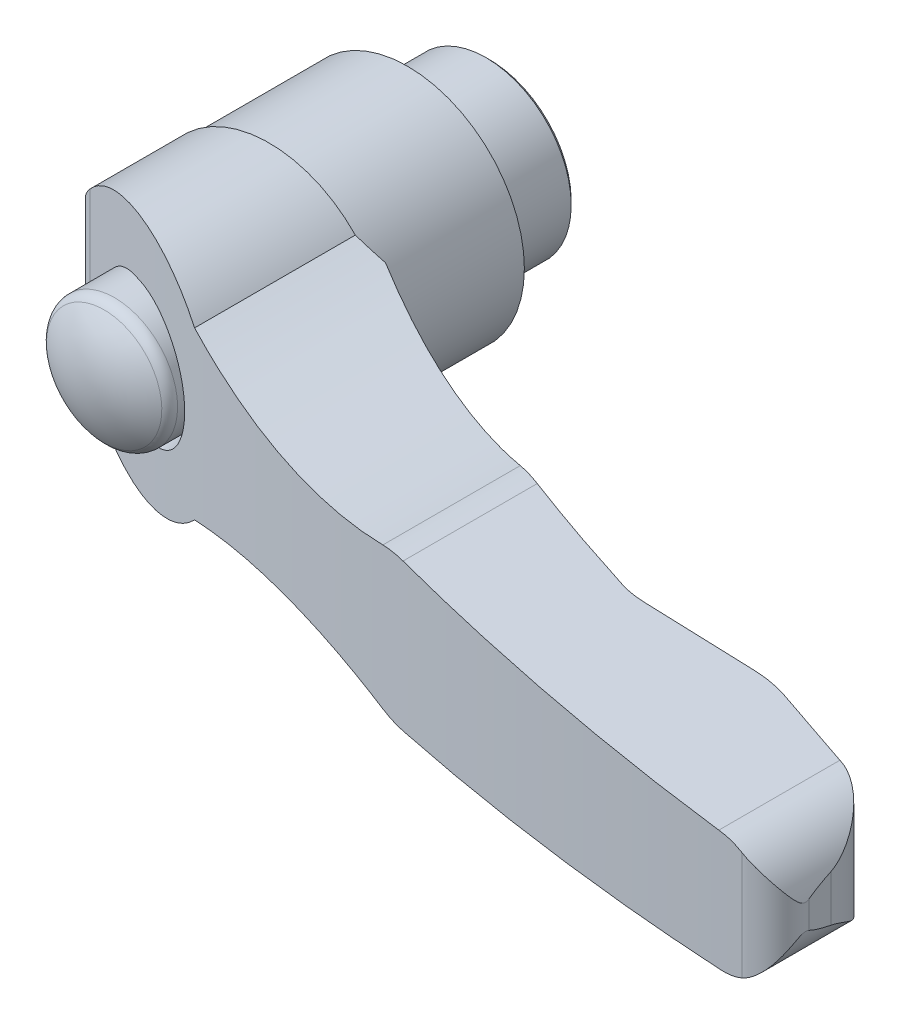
ISO-10303-21;
HEADER;
FILE_DESCRIPTION(('STEP AP214'),'2;1');
FILE_NAME('part.step','',(''),(''),'','','');
FILE_SCHEMA(('AUTOMOTIVE_DESIGN { 1 0 10303 214 1 1 1 1 }'));
ENDSEC;
DATA;
#1=APPLICATION_CONTEXT('core data for automotive mechanical design processes');
#2=APPLICATION_PROTOCOL_DEFINITION('international standard','automotive_design',2000,#1);
#3=PRODUCT_CONTEXT('',#1,'mechanical');
#4=PRODUCT('Part','Part','',(#3));
#5=PRODUCT_RELATED_PRODUCT_CATEGORY('part','',(#4));
#6=PRODUCT_DEFINITION_FORMATION('','',#4);
#7=PRODUCT_DEFINITION_CONTEXT('part definition',#1,'design');
#8=PRODUCT_DEFINITION('design','',#6,#7);
#9=PRODUCT_DEFINITION_SHAPE('','',#8);
#10=(LENGTH_UNIT() NAMED_UNIT(*) SI_UNIT(.MILLI.,.METRE.));
#11=(NAMED_UNIT(*) PLANE_ANGLE_UNIT() SI_UNIT($,.RADIAN.));
#12=(NAMED_UNIT(*) SI_UNIT($,.STERADIAN.) SOLID_ANGLE_UNIT());
#13=UNCERTAINTY_MEASURE_WITH_UNIT(LENGTH_MEASURE(1.E-05),#10,'distance_accuracy_value','');
#14=(GEOMETRIC_REPRESENTATION_CONTEXT(3) GLOBAL_UNCERTAINTY_ASSIGNED_CONTEXT((#13)) GLOBAL_UNIT_ASSIGNED_CONTEXT((#10,
#11,#12)) REPRESENTATION_CONTEXT('',''));
#15=CARTESIAN_POINT('',(0.,0.,0.));
#16=DIRECTION('',(0.,0.,1.));
#17=DIRECTION('',(1.,0.,0.));
#18=AXIS2_PLACEMENT_3D('',#15,#16,#17);
#19=CARTESIAN_POINT('',(3.225,0.,0.));
#20=DIRECTION('',(0.,0.,-1.));
#21=DIRECTION('',(0.,1.,0.));
#22=AXIS2_PLACEMENT_3D('',#19,#20,#21);
#23=PLANE('',#22);
#24=CARTESIAN_POINT('',(0.,0.,0.));
#25=DIRECTION('',(0.,0.,-1.));
#26=DIRECTION('',(-1.,0.,0.));
#27=AXIS2_PLACEMENT_3D('',#24,#25,#26);
#28=CIRCLE('',#27,3.4499999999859);
#29=CARTESIAN_POINT('',(-3.4499999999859,0.,0.));
#30=VERTEX_POINT('',#29);
#31=EDGE_CURVE('E9',#30,#30,#28,.F.);
#32=ORIENTED_EDGE('',*,*,#31,.T.);
#33=EDGE_LOOP('',(#32));
#34=FACE_BOUND('',#33,.T.);
#35=CARTESIAN_POINT('',(0.,0.,0.));
#36=DIRECTION('',(0.,0.,1.));
#37=DIRECTION('',(0.,-1.,0.));
#38=AXIS2_PLACEMENT_3D('',#35,#36,#37);
#39=CIRCLE('',#38,6.45000000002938);
#40=CARTESIAN_POINT('',(0.,-6.45000000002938,0.));
#41=VERTEX_POINT('',#40);
#42=EDGE_CURVE('E198',#41,#41,#39,.T.);
#43=ORIENTED_EDGE('',*,*,#42,.F.);
#44=EDGE_LOOP('',(#43));
#45=FACE_BOUND('',#44,.T.);
#46=ADVANCED_FACE('F14',(#34,#45),#23,.T.);
#47=CARTESIAN_POINT('',(0.,0.,0.299999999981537));
#48=DIRECTION('',(0.,0.,1.));
#49=DIRECTION('',(0.,-1.,0.));
#50=AXIS2_PLACEMENT_3D('',#47,#48,#49);
#51=CONICAL_SURFACE('',#50,6.75000000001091,0.785398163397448);
#52=ORIENTED_EDGE('',*,*,#42,.T.);
#53=EDGE_LOOP('',(#52));
#54=FACE_BOUND('',#53,.T.);
#55=CARTESIAN_POINT('',(0.,0.,0.3));
#56=DIRECTION('',(0.,0.,-1.));
#57=DIRECTION('',(0.,1.,0.));
#58=AXIS2_PLACEMENT_3D('',#55,#56,#57);
#59=CIRCLE('',#58,6.75);
#60=CARTESIAN_POINT('',(0.,6.75,0.3));
#61=VERTEX_POINT('',#60);
#62=EDGE_CURVE('E195',#61,#61,#59,.F.);
#63=ORIENTED_EDGE('',*,*,#62,.F.);
#64=EDGE_LOOP('',(#63));
#65=FACE_BOUND('',#64,.T.);
#66=ADVANCED_FACE('F460',(#54,#65),#51,.T.);
#67=CARTESIAN_POINT('',(0.,0.,8.4));
#68=DIRECTION('',(0.,0.,-1.));
#69=DIRECTION('',(0.,1.,0.));
#70=AXIS2_PLACEMENT_3D('',#67,#68,#69);
#71=CYLINDRICAL_SURFACE('',#70,6.75);
#72=ORIENTED_EDGE('',*,*,#62,.T.);
#73=EDGE_LOOP('',(#72));
#74=FACE_BOUND('',#73,.T.);
#75=CARTESIAN_POINT('',(0.,0.,7.15000000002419));
#76=DIRECTION('',(0.,0.,-1.));
#77=DIRECTION('',(1.,0.,0.));
#78=AXIS2_PLACEMENT_3D('',#75,#76,#77);
#79=CIRCLE('',#78,6.74999999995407);
#80=CARTESIAN_POINT('',(6.74999999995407,0.,7.15000000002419));
#81=VERTEX_POINT('',#80);
#82=EDGE_CURVE('E192',#81,#81,#79,.T.);
#83=ORIENTED_EDGE('',*,*,#82,.T.);
#84=EDGE_LOOP('',(#83));
#85=FACE_BOUND('',#84,.T.);
#86=ADVANCED_FACE('F465',(#74,#85),#71,.T.);
#87=CARTESIAN_POINT('',(0.,0.,6.9000000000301));
#88=DIRECTION('',(0.,0.,-1.));
#89=DIRECTION('',(0.,1.,0.));
#90=AXIS2_PLACEMENT_3D('',#87,#88,#89);
#91=CONICAL_SURFACE('',#90,7.000000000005,0.785398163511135);
#92=ORIENTED_EDGE('',*,*,#82,.F.);
#93=EDGE_LOOP('',(#92));
#94=FACE_BOUND('',#93,.T.);
#95=CARTESIAN_POINT('',(0.,0.,6.9));
#96=DIRECTION('',(0.,0.,-1.));
#97=DIRECTION('',(0.,1.,0.));
#98=AXIS2_PLACEMENT_3D('',#95,#96,#97);
#99=CIRCLE('',#98,7.);
#100=CARTESIAN_POINT('',(0.,7.,6.9));
#101=VERTEX_POINT('',#100);
#102=EDGE_CURVE('E184',#101,#101,#99,.T.);
#103=ORIENTED_EDGE('',*,*,#102,.T.);
#104=EDGE_LOOP('',(#103));
#105=FACE_BOUND('',#104,.T.);
#106=ADVANCED_FACE('F471',(#94,#105),#91,.F.);
#107=CARTESIAN_POINT('',(0.,0.,6.2));
#108=DIRECTION('',(0.,0.,-1.));
#109=DIRECTION('',(0.,1.,0.));
#110=AXIS2_PLACEMENT_3D('',#107,#108,#109);
#111=CYLINDRICAL_SURFACE('',#110,7.);
#112=ORIENTED_EDGE('',*,*,#102,.F.);
#113=EDGE_LOOP('',(#112));
#114=FACE_BOUND('',#113,.T.);
#115=CARTESIAN_POINT('',(0.,0.,6.5));
#116=DIRECTION('',(0.,0.,-1.));
#117=DIRECTION('',(0.,1.,0.));
#118=AXIS2_PLACEMENT_3D('',#115,#116,#117);
#119=CIRCLE('',#118,7.);
#120=CARTESIAN_POINT('',(0.,7.,6.5));
#121=VERTEX_POINT('',#120);
#122=EDGE_CURVE('E181',#121,#121,#119,.F.);
#123=ORIENTED_EDGE('',*,*,#122,.F.);
#124=EDGE_LOOP('',(#123));
#125=FACE_BOUND('',#124,.T.);
#126=ADVANCED_FACE('F477',(#114,#125),#111,.F.);
#127=CARTESIAN_POINT('',(-9.01003775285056,-19.,6.5));
#128=DIRECTION('',(0.707106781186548,0.,0.707106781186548));
#129=DIRECTION('',(-0.707106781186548,0.,0.707106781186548));
#130=AXIS2_PLACEMENT_3D('',#127,#128,#129);
#131=PLANE('',#130);
#132=DIRECTION('',(0.,1.,0.));
#133=VECTOR('',#132,1.);
#134=CARTESIAN_POINT('',(-9.01003775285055,0.,6.5));
#135=LINE('',#134,#133);
#136=CARTESIAN_POINT('',(-9.01003775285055,-2.13584185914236,6.5));
#137=VERTEX_POINT('',#136);
#138=CARTESIAN_POINT('',(-9.01003775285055,2.13584185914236,6.5));
#139=VERTEX_POINT('',#138);
#140=EDGE_CURVE('E165',#137,#139,#135,.T.);
#141=ORIENTED_EDGE('',*,*,#140,.F.);
#142=CARTESIAN_POINT('',(-0.00999999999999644,0.,-2.50003775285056));
#143=DIRECTION('',(0.707106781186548,0.,0.707106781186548));
#144=DIRECTION('',(-0.707106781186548,0.,0.707106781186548));
#145=AXIS2_PLACEMENT_3D('',#142,#143,#144);
#146=ELLIPSE('',#145,13.0814754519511,9.25);
#147=EDGE_CURVE('E168',#139,#137,#146,.T.);
#148=ORIENTED_EDGE('',*,*,#147,.F.);
#149=EDGE_LOOP('',(#141,#148));
#150=FACE_BOUND('',#149,.T.);
#151=ADVANCED_FACE('F170',(#150),#131,.F.);
#152=CARTESIAN_POINT('',(-4.635,0.,6.5));
#153=DIRECTION('',(0.,0.,-1.));
#154=DIRECTION('',(0.,1.,0.));
#155=AXIS2_PLACEMENT_3D('',#152,#153,#154);
#156=PLANE('',#155);
#157=ORIENTED_EDGE('',*,*,#140,.T.);
#158=CARTESIAN_POINT('',(-0.00999999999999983,0.,6.5));
#159=DIRECTION('',(0.,0.,1.));
#160=DIRECTION('',(-1.,0.,0.));
#161=AXIS2_PLACEMENT_3D('',#158,#159,#160);
#162=CIRCLE('',#161,9.25);
#163=EDGE_CURVE('E172',#137,#139,#162,.T.);
#164=ORIENTED_EDGE('',*,*,#163,.F.);
#165=EDGE_LOOP('',(#157,#164));
#166=FACE_BOUND('',#165,.T.);
#167=ORIENTED_EDGE('',*,*,#122,.T.);
#168=EDGE_LOOP('',(#167));
#169=FACE_BOUND('',#168,.T.);
#170=ADVANCED_FACE('F179',(#166,#169),#156,.T.);
#171=CARTESIAN_POINT('',(-0.0100000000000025,0.,13.5625));
#172=DIRECTION('',(0.,0.,1.));
#173=DIRECTION('',(-1.,0.,0.));
#174=AXIS2_PLACEMENT_3D('',#171,#172,#173);
#175=CYLINDRICAL_SURFACE('',#174,9.25);
#176=ORIENTED_EDGE('',*,*,#163,.T.);
#177=ORIENTED_EDGE('',*,*,#147,.T.);
#178=EDGE_LOOP('',(#176,#177));
#179=FACE_BOUND('',#178,.T.);
#180=CARTESIAN_POINT('',(-0.010000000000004,0.,17.5));
#181=DIRECTION('',(0.,0.,1.));
#182=DIRECTION('',(-1.,0.,0.));
#183=AXIS2_PLACEMENT_3D('',#180,#181,#182);
#184=CIRCLE('',#183,9.25);
#185=CARTESIAN_POINT('',(-9.26,0.,17.5));
#186=VERTEX_POINT('',#185);
#187=CARTESIAN_POINT('',(9.23999999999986,0.,17.5000000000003));
#188=VERTEX_POINT('',#187);
#189=EDGE_CURVE('E425',#186,#188,#184,.T.);
#190=ORIENTED_EDGE('',*,*,#189,.F.);
#191=CARTESIAN_POINT('',(-0.010000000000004,0.,17.5));
#192=DIRECTION('',(0.,0.,1.));
#193=DIRECTION('',(-1.,0.,0.));
#194=AXIS2_PLACEMENT_3D('',#191,#192,#193);
#195=CIRCLE('',#194,9.25);
#196=EDGE_CURVE('E434',#188,#186,#195,.T.);
#197=ORIENTED_EDGE('',*,*,#196,.F.);
#198=EDGE_LOOP('',(#190,#197));
#199=FACE_BOUND('',#198,.T.);
#200=ADVANCED_FACE('F174',(#179,#199),#175,.T.);
#201=CARTESIAN_POINT('',(0.,0.,24.));
#202=DIRECTION('',(1.,0.,0.));
#203=DIRECTION('',(0.,0.,1.));
#204=AXIS2_PLACEMENT_3D('',#201,#202,#203);
#205=SPHERICAL_SURFACE('',#204,8.);
#206=CARTESIAN_POINT('',(0.,0.,30.5652144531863));
#207=DIRECTION('',(0.,0.,1.));
#208=DIRECTION('',(0.,-1.,0.));
#209=AXIS2_PLACEMENT_3D('',#206,#207,#208);
#210=CIRCLE('',#209,4.57142857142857);
#211=CARTESIAN_POINT('',(0.,-4.57142857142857,30.5652144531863));
#212=VERTEX_POINT('',#211);
#213=EDGE_CURVE('E409',#212,#212,#210,.F.);
#214=ORIENTED_EDGE('',*,*,#213,.F.);
#215=EDGE_LOOP('',(#214));
#216=FACE_BOUND('',#215,.T.);
#217=ADVANCED_FACE('F491',(#216),#205,.T.);
#218=CARTESIAN_POINT('',(64.6274051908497,-10.5,37.5817950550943));
#219=DIRECTION('',(0.992331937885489,0.,-0.123601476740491));
#220=DIRECTION('',(0.123601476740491,0.,0.992331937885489));
#221=AXIS2_PLACEMENT_3D('',#218,#219,#220);
#222=PLANE('',#221);
#223=CARTESIAN_POINT('',(60.25,0.,2.43788666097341));
#224=DIRECTION('',(0.992331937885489,0.,-0.123601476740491));
#225=DIRECTION('',(0.123601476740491,0.,0.992331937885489));
#226=AXIS2_PLACEMENT_3D('',#223,#224,#225);
#227=ELLIPSE('',#226,38.4299615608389,4.75);
#228=CARTESIAN_POINT('',(64.8745408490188,1.08449155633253,39.5659186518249));
#229=VERTEX_POINT('',#228);
#230=CARTESIAN_POINT('',(64.6274051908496,1.84413226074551,37.5817950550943));
#231=VERTEX_POINT('',#230);
#232=EDGE_CURVE('E559',#229,#231,#227,.F.);
#233=ORIENTED_EDGE('',*,*,#232,.F.);
#234=DIRECTION('',(0.,-1.,0.));
#235=VECTOR('',#234,1.);
#236=CARTESIAN_POINT('',(64.8745408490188,-10.5,39.5659186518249));
#237=LINE('',#236,#235);
#238=CARTESIAN_POINT('',(64.8745408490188,-1.08449155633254,39.5659186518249));
#239=VERTEX_POINT('',#238);
#240=EDGE_CURVE('E550',#239,#229,#237,.F.);
#241=ORIENTED_EDGE('',*,*,#240,.F.);
#242=CARTESIAN_POINT('',(60.25,0.,2.43788666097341));
#243=DIRECTION('',(0.992331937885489,0.,-0.123601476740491));
#244=DIRECTION('',(0.123601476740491,0.,0.992331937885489));
#245=AXIS2_PLACEMENT_3D('',#242,#243,#244);
#246=ELLIPSE('',#245,38.4299615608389,4.75);
#247=CARTESIAN_POINT('',(64.6274051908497,-1.84413226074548,37.5817950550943));
#248=VERTEX_POINT('',#247);
#249=EDGE_CURVE('E526',#248,#239,#246,.F.);
#250=ORIENTED_EDGE('',*,*,#249,.F.);
#251=DIRECTION('',(0.,-1.,0.));
#252=VECTOR('',#251,1.);
#253=CARTESIAN_POINT('',(64.6274051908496,-10.5,37.5817950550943));
#254=LINE('',#253,#252);
#255=EDGE_CURVE('E177',#231,#248,#254,.T.);
#256=ORIENTED_EDGE('',*,*,#255,.F.);
#257=EDGE_LOOP('',(#233,#241,#250,#256));
#258=FACE_BOUND('',#257,.T.);
#259=ADVANCED_FACE('F497',(#258),#222,.T.);
#260=CARTESIAN_POINT('',(58.6337202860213,-10.5,38.3283479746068));
#261=DIRECTION('',(0.,-1.,0.));
#262=DIRECTION('',(1.,0.,0.));
#263=AXIS2_PLACEMENT_3D('',#260,#261,#262);
#264=CYLINDRICAL_SURFACE('',#263,6.04);
#265=CARTESIAN_POINT('',(64.6274051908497,1.84413226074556,37.5817950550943));
#266=CARTESIAN_POINT('',(64.6175868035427,1.86745330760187,37.5030045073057));
#267=CARTESIAN_POINT('',(64.6063375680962,1.89362327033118,37.4253204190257));
#268=CARTESIAN_POINT('',(64.5811702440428,1.95049016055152,37.2721928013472));
#269=CARTESIAN_POINT('',(64.5672561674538,1.98118026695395,37.1967460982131));
#270=CARTESIAN_POINT('',(64.5369883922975,2.04585034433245,37.0482136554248));
#271=CARTESIAN_POINT('',(64.520645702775,2.07981523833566,36.9751189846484));
#272=CARTESIAN_POINT('',(64.4855821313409,2.15032519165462,36.8307396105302));
#273=CARTESIAN_POINT('',(64.4668602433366,2.18687133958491,36.7594556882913));
#274=CARTESIAN_POINT('',(64.4072221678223,2.29938724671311,36.547961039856));
#275=CARTESIAN_POINT('',(64.3628565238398,2.37818379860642,36.410218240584));
#276=CARTESIAN_POINT('',(64.2652007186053,2.53960895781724,36.1400450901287));
#277=CARTESIAN_POINT('',(64.2118976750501,2.6222429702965,36.007622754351));
#278=CARTESIAN_POINT('',(64.077119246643,2.81672317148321,35.7040219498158));
#279=CARTESIAN_POINT('',(63.9921849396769,2.92909268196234,35.5347005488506));
#280=CARTESIAN_POINT('',(63.8063278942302,3.15216626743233,35.2039790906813));
#281=CARTESIAN_POINT('',(63.7054078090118,3.26287061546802,35.0425777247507));
#282=CARTESIAN_POINT('',(63.4870671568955,3.47959027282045,34.7278934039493));
#283=CARTESIAN_POINT('',(63.369645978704,3.58560540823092,34.5746107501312));
#284=CARTESIAN_POINT('',(63.1179209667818,3.78996521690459,34.277236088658));
#285=CARTESIAN_POINT('',(62.9836257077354,3.88831374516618,34.1331394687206));
#286=CARTESIAN_POINT('',(62.6561598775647,4.10136712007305,33.815313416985));
#287=CARTESIAN_POINT('',(62.4571888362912,4.21258905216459,33.6450495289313));
#288=CARTESIAN_POINT('',(62.1378586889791,4.36029911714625,33.4069452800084));
#289=CARTESIAN_POINT('',(62.0281124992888,4.40629516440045,33.3305585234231));
#290=CARTESIAN_POINT('',(61.8018114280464,4.49098569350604,33.1841350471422));
#291=CARTESIAN_POINT('',(61.6852609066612,4.52968478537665,33.1140943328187));
#292=CARTESIAN_POINT('',(61.4786111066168,4.58924867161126,32.9993621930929));
#293=CARTESIAN_POINT('',(61.3900115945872,4.61209493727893,32.9529824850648));
#294=CARTESIAN_POINT('',(61.2097340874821,4.65295056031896,32.8642982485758));
#295=CARTESIAN_POINT('',(61.1180570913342,4.67096147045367,32.82199241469));
#296=CARTESIAN_POINT('',(60.9313596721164,4.70183469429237,32.7415027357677));
#297=CARTESIAN_POINT('',(60.8363219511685,4.71466416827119,32.7033462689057));
#298=CARTESIAN_POINT('',(60.6438287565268,4.73463763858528,32.631712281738));
#299=CARTESIAN_POINT('',(60.5463713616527,4.74177695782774,32.5982386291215));
#300=CARTESIAN_POINT('',(60.4479724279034,4.74587261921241,32.5672639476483));
#301=B_SPLINE_CURVE_WITH_KNOTS('',3,(#265,#266,#267,#268,#269,#270,#271,#272,#273,#274,#275,
#276,#277,#278,#279,#280,#281,#282,#283,#284,#285,#286,#287,#288,#289,#290,#291,#292,#293,#294,
#295,#296,#297,#298,#299,#300),.UNSPECIFIED.,.F.,.F.,(4,2,2,2,2,2,2,2,2,2,2,2,2,2,2,2,2,4),(0.,
0.248076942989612,0.495783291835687,0.742399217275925,0.989119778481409,1.48293160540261,
1.97746142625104,2.63745339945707,3.29733594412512,3.95724294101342,4.61681594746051,
5.46693586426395,5.89075482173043,6.31430511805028,6.62183365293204,6.92926331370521,
7.23861197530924,7.54821464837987),.UNSPECIFIED.);
#302=CARTESIAN_POINT('',(60.4479724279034,4.74587261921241,32.5672639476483));
#303=VERTEX_POINT('',#302);
#304=EDGE_CURVE('E510',#231,#303,#301,.T.);
#305=ORIENTED_EDGE('',*,*,#304,.F.);
#306=ORIENTED_EDGE('',*,*,#255,.T.);
#307=CARTESIAN_POINT('',(60.4479724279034,-4.74587261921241,32.5672639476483));
#308=CARTESIAN_POINT('',(60.5755504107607,-4.74057354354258,32.6074069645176));
#309=CARTESIAN_POINT('',(60.7015088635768,-4.73014540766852,32.6517620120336));
#310=CARTESIAN_POINT('',(60.9490652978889,-4.69992242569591,32.7481786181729));
#311=CARTESIAN_POINT('',(61.0706698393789,-4.6801423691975,32.8002279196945));
#312=CARTESIAN_POINT('',(61.3074659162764,-4.63235500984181,32.9108206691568));
#313=CARTESIAN_POINT('',(61.4227141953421,-4.60444273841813,32.9692844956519));
#314=CARTESIAN_POINT('',(61.6477173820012,-4.54120548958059,33.0925213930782));
#315=CARTESIAN_POINT('',(61.7574696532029,-4.50587699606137,33.1572974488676));
#316=CARTESIAN_POINT('',(61.9940137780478,-4.42040174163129,33.307032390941));
#317=CARTESIAN_POINT('',(62.1193938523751,-4.36870213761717,33.3933358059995));
#318=CARTESIAN_POINT('',(62.3610721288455,-4.25718277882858,33.5732278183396));
#319=CARTESIAN_POINT('',(62.4773638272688,-4.19735729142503,33.6668215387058));
#320=CARTESIAN_POINT('',(62.7012840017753,-4.07066877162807,33.8608437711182));
#321=CARTESIAN_POINT('',(62.8088611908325,-4.0037687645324,33.9613071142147));
#322=CARTESIAN_POINT('',(63.0146476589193,-3.86453813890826,34.1677809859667));
#323=CARTESIAN_POINT('',(63.1128596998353,-3.79220913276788,34.2737898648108));
#324=CARTESIAN_POINT('',(63.3331746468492,-3.61700510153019,34.5290929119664));
#325=CARTESIAN_POINT('',(63.4514763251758,-3.51235864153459,34.6804594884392));
#326=CARTESIAN_POINT('',(63.6718053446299,-3.29808480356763,34.9913387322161));
#327=CARTESIAN_POINT('',(63.7738256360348,-3.18845529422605,35.1508548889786));
#328=CARTESIAN_POINT('',(63.961662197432,-2.9676568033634,35.4770445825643));
#329=CARTESIAN_POINT('',(64.0475378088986,-2.85649513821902,35.6436890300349));
#330=CARTESIAN_POINT('',(64.2038484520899,-2.63586419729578,35.9851508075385));
#331=CARTESIAN_POINT('',(64.2742871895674,-2.52639452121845,36.1599661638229));
#332=CARTESIAN_POINT('',(64.3705847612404,-2.36382517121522,36.4361542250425));
#333=CARTESIAN_POINT('',(64.4019853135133,-2.30809068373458,36.5340606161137));
#334=CARTESIAN_POINT('',(64.4601539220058,-2.20019362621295,36.7330390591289));
#335=CARTESIAN_POINT('',(64.4869269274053,-2.14802727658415,36.8341075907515));
#336=CARTESIAN_POINT('',(64.5357331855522,-2.04890785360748,37.0402846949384));
#337=CARTESIAN_POINT('',(64.5577546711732,-2.00196785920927,37.1454025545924));
#338=CARTESIAN_POINT('',(64.596614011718,-1.91618262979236,37.360168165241));
#339=CARTESIAN_POINT('',(64.6134353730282,-1.87736327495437,37.4698291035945));
#340=CARTESIAN_POINT('',(64.6274051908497,-1.84413226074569,37.5817950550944));
#341=B_SPLINE_CURVE_WITH_KNOTS('',3,(#307,#308,#309,#310,#311,#312,#313,#314,#315,#316,#317,
#318,#319,#320,#321,#322,#323,#324,#325,#326,#327,#328,#329,#330,#331,#332,#333,#334,#335,#336,
#337,#338,#339,#340),.UNSPECIFIED.,.F.,.F.,(4,2,2,2,2,2,2,2,2,2,2,2,2,2,2,2,4),(0.,
0.401264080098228,0.801895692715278,1.19802151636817,1.59433557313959,2.0758833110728,
2.55777255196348,3.04231807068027,3.52672024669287,4.18208013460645,4.83772302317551,
5.49090678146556,6.1439335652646,6.49464389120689,6.84497677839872,7.19616755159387,
7.54846105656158),.UNSPECIFIED.);
#342=CARTESIAN_POINT('',(60.4479724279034,-4.74587261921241,32.5672639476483));
#343=VERTEX_POINT('',#342);
#344=EDGE_CURVE('E518',#343,#248,#341,.T.);
#345=ORIENTED_EDGE('',*,*,#344,.F.);
#346=DIRECTION('',(0.,-1.,0.));
#347=VECTOR('',#346,1.);
#348=CARTESIAN_POINT('',(60.4479724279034,-10.5,32.5672639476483));
#349=LINE('',#348,#347);
#350=EDGE_CURVE('E423',#303,#343,#349,.T.);
#351=ORIENTED_EDGE('',*,*,#350,.F.);
#352=EDGE_LOOP('',(#305,#306,#345,#351));
#353=FACE_BOUND('',#352,.T.);
#354=ADVANCED_FACE('F501',(#353),#264,.T.);
#355=CARTESIAN_POINT('',(-9.26,-10.5,17.5));
#356=DIRECTION('',(0.,0.,-1.));
#357=DIRECTION('',(0.,1.,0.));
#358=AXIS2_PLACEMENT_3D('',#355,#356,#357);
#359=PLANE('',#358);
#360=DIRECTION('',(0.,-1.,0.));
#361=VECTOR('',#360,1.);
#362=CARTESIAN_POINT('',(-9.26,-10.5,17.5));
#363=LINE('',#362,#361);
#364=CARTESIAN_POINT('',(-9.26,2.12188595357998,17.5));
#365=VERTEX_POINT('',#364);
#366=EDGE_CURVE('E432',#365,#186,#363,.T.);
#367=ORIENTED_EDGE('',*,*,#366,.F.);
#368=CARTESIAN_POINT('',(0.,0.,17.5));
#369=DIRECTION('',(0.,0.,1.));
#370=DIRECTION('',(0.,-1.,0.));
#371=AXIS2_PLACEMENT_3D('',#368,#369,#370);
#372=CIRCLE('',#371,9.5);
#373=CARTESIAN_POINT('',(6.84374087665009,6.58887022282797,17.5));
#374=VERTEX_POINT('',#373);
#375=EDGE_CURVE('E346',#374,#365,#372,.T.);
#376=ORIENTED_EDGE('',*,*,#375,.F.);
#377=CARTESIAN_POINT('',(19.25,44.09,17.5));
#378=DIRECTION('',(0.,0.,1.));
#379=DIRECTION('',(0.,-1.,0.));
#380=AXIS2_PLACEMENT_3D('',#377,#378,#379);
#381=CIRCLE('',#380,39.5);
#382=CARTESIAN_POINT('',(9.23999999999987,5.8794006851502,17.5000000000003));
#383=VERTEX_POINT('',#382);
#384=EDGE_CURVE('E306',#374,#383,#381,.T.);
#385=ORIENTED_EDGE('',*,*,#384,.T.);
#386=DIRECTION('',(0.,-1.,0.));
#387=VECTOR('',#386,1.);
#388=CARTESIAN_POINT('',(9.23999999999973,-10.5,17.5000000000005));
#389=LINE('',#388,#387);
#390=EDGE_CURVE('E412',#383,#188,#389,.T.);
#391=ORIENTED_EDGE('',*,*,#390,.T.);
#392=ORIENTED_EDGE('',*,*,#196,.T.);
#393=EDGE_LOOP('',(#367,#376,#385,#391,#392));
#394=FACE_BOUND('',#393,.T.);
#395=ADVANCED_FACE('F506',(#394),#359,.T.);
#396=CARTESIAN_POINT('',(-9.26,-10.5,21.2038249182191));
#397=DIRECTION('',(-1.,0.,0.));
#398=DIRECTION('',(0.,-1.,0.));
#399=AXIS2_PLACEMENT_3D('',#396,#397,#398);
#400=PLANE('',#399);
#401=ORIENTED_EDGE('',*,*,#366,.T.);
#402=DIRECTION('',(0.,1.,0.));
#403=VECTOR('',#402,1.);
#404=CARTESIAN_POINT('',(-9.26,-10.5,17.5));
#405=LINE('',#404,#403);
#406=CARTESIAN_POINT('',(-9.26,-2.12188595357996,17.5));
#407=VERTEX_POINT('',#406);
#408=EDGE_CURVE('E426',#407,#186,#405,.T.);
#409=ORIENTED_EDGE('',*,*,#408,.F.);
#410=DIRECTION('',(0.,0.,1.));
#411=VECTOR('',#410,1.);
#412=CARTESIAN_POINT('',(-9.26,-2.12188595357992,42.5));
#413=LINE('',#412,#411);
#414=CARTESIAN_POINT('',(-9.26,-2.12188595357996,21.2038249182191));
#415=VERTEX_POINT('',#414);
#416=EDGE_CURVE('E429',#415,#407,#413,.F.);
#417=ORIENTED_EDGE('',*,*,#416,.F.);
#418=DIRECTION('',(0.,-1.,0.));
#419=VECTOR('',#418,1.);
#420=CARTESIAN_POINT('',(-9.26,-10.5,21.2038249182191));
#421=LINE('',#420,#419);
#422=CARTESIAN_POINT('',(-9.26,2.12188595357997,21.2038249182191));
#423=VERTEX_POINT('',#422);
#424=EDGE_CURVE('E628',#423,#415,#421,.T.);
#425=ORIENTED_EDGE('',*,*,#424,.F.);
#426=DIRECTION('',(0.,0.,1.));
#427=VECTOR('',#426,1.);
#428=CARTESIAN_POINT('',(-9.26,2.12188595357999,42.5));
#429=LINE('',#428,#427);
#430=EDGE_CURVE('E349',#365,#423,#429,.T.);
#431=ORIENTED_EDGE('',*,*,#430,.F.);
#432=EDGE_LOOP('',(#401,#409,#417,#425,#431));
#433=FACE_BOUND('',#432,.T.);
#434=ADVANCED_FACE('F710',(#433),#400,.T.);
#435=CARTESIAN_POINT('',(-9.26,-10.5,17.5));
#436=DIRECTION('',(0.,0.,-1.));
#437=DIRECTION('',(0.,1.,0.));
#438=AXIS2_PLACEMENT_3D('',#435,#436,#437);
#439=PLANE('',#438);
#440=DIRECTION('',(0.,-1.,0.));
#441=VECTOR('',#440,1.);
#442=CARTESIAN_POINT('',(9.23999999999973,-10.5,17.5000000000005));
#443=LINE('',#442,#441);
#444=CARTESIAN_POINT('',(9.23999999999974,-5.87940068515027,17.5000000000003));
#445=VERTEX_POINT('',#444);
#446=EDGE_CURVE('E410',#188,#445,#443,.T.);
#447=ORIENTED_EDGE('',*,*,#446,.T.);
#448=CARTESIAN_POINT('',(19.25,-44.09,17.5));
#449=DIRECTION('',(0.,0.,1.));
#450=DIRECTION('',(0.,-1.,0.));
#451=AXIS2_PLACEMENT_3D('',#448,#449,#450);
#452=CIRCLE('',#451,39.5);
#453=CARTESIAN_POINT('',(6.84374087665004,-6.588870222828,17.5));
#454=VERTEX_POINT('',#453);
#455=EDGE_CURVE('E627',#445,#454,#452,.T.);
#456=ORIENTED_EDGE('',*,*,#455,.T.);
#457=CARTESIAN_POINT('',(0.,0.,17.5));
#458=DIRECTION('',(0.,0.,1.));
#459=DIRECTION('',(0.,-1.,0.));
#460=AXIS2_PLACEMENT_3D('',#457,#458,#459);
#461=CIRCLE('',#460,9.5);
#462=EDGE_CURVE('E631',#407,#454,#461,.T.);
#463=ORIENTED_EDGE('',*,*,#462,.F.);
#464=ORIENTED_EDGE('',*,*,#408,.T.);
#465=ORIENTED_EDGE('',*,*,#189,.T.);
#466=EDGE_LOOP('',(#447,#456,#463,#464,#465));
#467=FACE_BOUND('',#466,.T.);
#468=ADVANCED_FACE('F708',(#467),#439,.T.);
#469=CARTESIAN_POINT('',(53.8294507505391,-10.5,30.4829917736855));
#470=DIRECTION('',(0.300372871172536,0.,-0.95382185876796));
#471=DIRECTION('',(0.95382185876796,0.,0.300372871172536));
#472=AXIS2_PLACEMENT_3D('',#469,#470,#471);
#473=PLANE('',#472);
#474=CARTESIAN_POINT('',(60.25,0.,32.5049194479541));
#475=DIRECTION('',(0.300372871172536,0.,-0.95382185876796));
#476=DIRECTION('',(0.95382185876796,0.,0.300372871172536));
#477=AXIS2_PLACEMENT_3D('',#474,#475,#476);
#478=ELLIPSE('',#477,4.97996555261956,4.75);
#479=CARTESIAN_POINT('',(60.25,4.75,32.5049194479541));
#480=VERTEX_POINT('',#479);
#481=EDGE_CURVE('E551',#303,#480,#478,.F.);
#482=ORIENTED_EDGE('',*,*,#481,.F.);
#483=ORIENTED_EDGE('',*,*,#350,.T.);
#484=CARTESIAN_POINT('',(60.25,0.,32.5049194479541));
#485=DIRECTION('',(0.300372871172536,0.,-0.95382185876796));
#486=DIRECTION('',(0.95382185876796,0.,0.300372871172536));
#487=AXIS2_PLACEMENT_3D('',#484,#485,#486);
#488=ELLIPSE('',#487,4.97996555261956,4.75);
#489=CARTESIAN_POINT('',(60.25,-4.75,32.5049194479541));
#490=VERTEX_POINT('',#489);
#491=EDGE_CURVE('E527',#490,#343,#488,.F.);
#492=ORIENTED_EDGE('',*,*,#491,.F.);
#493=DIRECTION('',(-0.953255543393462,-0.0344545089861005,-0.300194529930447));
#494=VECTOR('',#493,1.);
#495=CARTESIAN_POINT('',(60.25,-4.75,32.5049194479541));
#496=LINE('',#495,#494);
#497=CARTESIAN_POINT('',(53.8294507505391,-4.98206460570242,30.4829917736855));
#498=VERTEX_POINT('',#497);
#499=EDGE_CURVE('E618',#490,#498,#496,.T.);
#500=ORIENTED_EDGE('',*,*,#499,.T.);
#501=DIRECTION('',(0.,-1.,0.));
#502=VECTOR('',#501,1.);
#503=CARTESIAN_POINT('',(53.8294507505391,-10.5,30.4829917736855));
#504=LINE('',#503,#502);
#505=CARTESIAN_POINT('',(53.8294507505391,4.98206460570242,30.4829917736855));
#506=VERTEX_POINT('',#505);
#507=EDGE_CURVE('E420',#506,#498,#504,.T.);
#508=ORIENTED_EDGE('',*,*,#507,.F.);
#509=DIRECTION('',(0.953255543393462,-0.0344545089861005,0.300194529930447));
#510=VECTOR('',#509,1.);
#511=CARTESIAN_POINT('',(53.8294507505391,4.98206460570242,30.4829917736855));
#512=LINE('',#511,#510);
#513=EDGE_CURVE('E305',#506,#480,#512,.T.);
#514=ORIENTED_EDGE('',*,*,#513,.T.);
#515=EDGE_LOOP('',(#482,#483,#492,#500,#508,#514));
#516=FACE_BOUND('',#515,.T.);
#517=ADVANCED_FACE('F593',(#516),#473,.T.);
#518=CARTESIAN_POINT('',(51.0780352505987,-10.5,39.22));
#519=DIRECTION('',(0.,-1.,0.));
#520=DIRECTION('',(1.,0.,0.));
#521=AXIS2_PLACEMENT_3D('',#518,#519,#520);
#522=CYLINDRICAL_SURFACE('',#521,9.15999999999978);
#523=CARTESIAN_POINT('',(51.0780352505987,5.08151188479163,39.22));
#524=DIRECTION('',(-0.0361204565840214,-0.999347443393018,0.));
#525=DIRECTION('',(0.999347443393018,-0.0361204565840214,0.));
#526=AXIS2_PLACEMENT_3D('',#523,#524,#525);
#527=ELLIPSE('',#526,9.16598132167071,9.15999999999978);
#528=CARTESIAN_POINT('',(51.0780352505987,5.08151188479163,30.06));
#529=VERTEX_POINT('',#528);
#530=EDGE_CURVE('E308',#529,#506,#527,.T.);
#531=ORIENTED_EDGE('',*,*,#530,.T.);
#532=ORIENTED_EDGE('',*,*,#507,.T.);
#533=CARTESIAN_POINT('',(51.0780352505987,-5.08151188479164,39.22));
#534=DIRECTION('',(-0.0361204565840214,0.999347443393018,0.));
#535=DIRECTION('',(-0.999347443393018,-0.0361204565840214,0.));
#536=AXIS2_PLACEMENT_3D('',#533,#534,#535);
#537=ELLIPSE('',#536,9.16598132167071,9.15999999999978);
#538=CARTESIAN_POINT('',(51.0780352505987,-5.08151188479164,30.06));
#539=VERTEX_POINT('',#538);
#540=EDGE_CURVE('E617',#498,#539,#537,.T.);
#541=ORIENTED_EDGE('',*,*,#540,.T.);
#542=DIRECTION('',(0.,1.,0.));
#543=VECTOR('',#542,1.);
#544=CARTESIAN_POINT('',(51.0780352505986,-10.5,30.06));
#545=LINE('',#544,#543);
#546=EDGE_CURVE('E417',#529,#539,#545,.F.);
#547=ORIENTED_EDGE('',*,*,#546,.F.);
#548=EDGE_LOOP('',(#531,#532,#541,#547));
#549=FACE_BOUND('',#548,.T.);
#550=ADVANCED_FACE('F660',(#549),#522,.T.);
#551=CARTESIAN_POINT('',(42.239481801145,-10.5,30.06));
#552=DIRECTION('',(0.,0.,-1.));
#553=DIRECTION('',(0.,1.,0.));
#554=AXIS2_PLACEMENT_3D('',#551,#552,#553);
#555=PLANE('',#554);
#556=DIRECTION('',(0.999347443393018,-0.0361204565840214,0.));
#557=VECTOR('',#556,1.);
#558=CARTESIAN_POINT('',(30.3472861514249,5.83080496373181,30.06));
#559=LINE('',#558,#557);
#560=CARTESIAN_POINT('',(42.239481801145,5.4009729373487,30.06));
#561=VERTEX_POINT('',#560);
#562=EDGE_CURVE('E585',#561,#529,#559,.T.);
#563=ORIENTED_EDGE('',*,*,#562,.T.);
#564=ORIENTED_EDGE('',*,*,#546,.T.);
#565=DIRECTION('',(-0.999347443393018,-0.0361204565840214,0.));
#566=VECTOR('',#565,1.);
#567=CARTESIAN_POINT('',(60.25,-4.75,30.06));
#568=LINE('',#567,#566);
#569=CARTESIAN_POINT('',(42.239481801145,-5.4009729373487,30.06));
#570=VERTEX_POINT('',#569);
#571=EDGE_CURVE('E614',#539,#570,#568,.T.);
#572=ORIENTED_EDGE('',*,*,#571,.T.);
#573=DIRECTION('',(0.,-1.,0.));
#574=VECTOR('',#573,1.);
#575=CARTESIAN_POINT('',(42.239481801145,-10.5,30.06));
#576=LINE('',#575,#574);
#577=EDGE_CURVE('E415',#570,#561,#576,.F.);
#578=ORIENTED_EDGE('',*,*,#577,.T.);
#579=EDGE_LOOP('',(#563,#564,#572,#578));
#580=FACE_BOUND('',#579,.T.);
#581=ADVANCED_FACE('F698',(#580),#555,.T.);
#582=CARTESIAN_POINT('',(42.2394818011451,-10.5,23.0799999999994));
#583=DIRECTION('',(0.,-1.,0.));
#584=DIRECTION('',(1.,0.,0.));
#585=AXIS2_PLACEMENT_3D('',#582,#583,#584);
#586=CYLINDRICAL_SURFACE('',#585,6.98000000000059);
#587=DIRECTION('',(0.,-1.,0.));
#588=VECTOR('',#587,1.);
#589=CARTESIAN_POINT('',(40.3024609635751,-10.5,29.785844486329));
#590=LINE('',#589,#588);
#591=CARTESIAN_POINT('',(40.3024609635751,-5.47098470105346,29.7858444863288));
#592=VERTEX_POINT('',#591);
#593=CARTESIAN_POINT('',(40.3024609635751,5.47098470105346,29.7858444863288));
#594=VERTEX_POINT('',#593);
#595=EDGE_CURVE('E407',#592,#594,#590,.F.);
#596=ORIENTED_EDGE('',*,*,#595,.T.);
#597=CARTESIAN_POINT('',(42.2394818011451,5.40097293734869,23.0799999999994));
#598=DIRECTION('',(-0.0361204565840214,-0.999347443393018,0.));
#599=DIRECTION('',(0.999347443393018,-0.0361204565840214,0.));
#600=AXIS2_PLACEMENT_3D('',#597,#598,#599);
#601=ELLIPSE('',#600,6.98455781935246,6.98000000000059);
#602=EDGE_CURVE('E583',#594,#561,#601,.F.);
#603=ORIENTED_EDGE('',*,*,#602,.T.);
#604=ORIENTED_EDGE('',*,*,#577,.F.);
#605=CARTESIAN_POINT('',(42.2394818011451,-5.4009729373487,23.0799999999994));
#606=DIRECTION('',(-0.0361204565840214,0.999347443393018,0.));
#607=DIRECTION('',(-0.999347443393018,-0.0361204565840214,0.));
#608=AXIS2_PLACEMENT_3D('',#605,#606,#607);
#609=ELLIPSE('',#608,6.98455781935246,6.98000000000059);
#610=EDGE_CURVE('E616',#570,#592,#609,.F.);
#611=ORIENTED_EDGE('',*,*,#610,.T.);
#612=EDGE_LOOP('',(#596,#603,#604,#611));
#613=FACE_BOUND('',#612,.T.);
#614=ADVANCED_FACE('F316',(#613),#586,.F.);
#615=CARTESIAN_POINT('',(88.9416647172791,-10.5,-138.600024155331));
#616=DIRECTION('',(0.,-1.,0.));
#617=DIRECTION('',(1.,0.,0.));
#618=AXIS2_PLACEMENT_3D('',#615,#616,#617);
#619=CYLINDRICAL_SURFACE('',#618,175.27);
#620=CARTESIAN_POINT('',(30.3472861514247,5.83080496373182,26.5855433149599));
#621=CARTESIAN_POINT('',(30.1696679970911,5.83722947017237,26.5225405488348));
#622=CARTESIAN_POINT('',(29.9919650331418,5.83772087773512,26.45918181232));
#623=CARTESIAN_POINT('',(29.6377732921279,5.82691956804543,26.3322542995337));
#624=CARTESIAN_POINT('',(29.461282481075,5.81567269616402,26.2686872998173));
#625=CARTESIAN_POINT('',(29.1095062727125,5.78152581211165,26.1413510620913));
#626=CARTESIAN_POINT('',(28.9342208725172,5.75862582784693,26.0775818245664));
#627=CARTESIAN_POINT('',(28.5848474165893,5.70116062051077,25.9498538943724));
#628=CARTESIAN_POINT('',(28.4107667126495,5.6665501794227,25.8858954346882));
#629=CARTESIAN_POINT('',(28.2379732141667,5.62616845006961,25.8220994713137));
#630=B_SPLINE_CURVE_WITH_KNOTS('',3,(#620,#621,#622,#623,#624,#625,#626,#627,#628,#629),
.UNSPECIFIED.,.F.,.F.,(4,2,2,2,4),(0.,0.565613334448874,1.1290258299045,1.69243697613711,
2.2580489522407),.UNSPECIFIED.);
#631=CARTESIAN_POINT('',(30.3472861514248,5.83080496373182,26.5855433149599));
#632=VERTEX_POINT('',#631);
#633=CARTESIAN_POINT('',(28.2379732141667,5.62616845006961,25.8220994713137));
#634=VERTEX_POINT('',#633);
#635=EDGE_CURVE('E296',#632,#634,#630,.T.);
#636=ORIENTED_EDGE('',*,*,#635,.F.);
#637=CARTESIAN_POINT('',(88.9416647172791,3.71296724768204,-138.600024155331));
#638=DIRECTION('',(-0.0361204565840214,-0.999347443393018,0.));
#639=DIRECTION('',(0.999347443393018,-0.0361204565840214,0.));
#640=AXIS2_PLACEMENT_3D('',#637,#638,#639);
#641=ELLIPSE('',#640,175.384448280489,175.27);
#642=EDGE_CURVE('E578',#632,#594,#641,.F.);
#643=ORIENTED_EDGE('',*,*,#642,.T.);
#644=ORIENTED_EDGE('',*,*,#595,.F.);
#645=CARTESIAN_POINT('',(88.9416647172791,-3.71296724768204,-138.600024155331));
#646=DIRECTION('',(-0.0361204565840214,0.999347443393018,0.));
#647=DIRECTION('',(-0.999347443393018,-0.0361204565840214,0.));
#648=AXIS2_PLACEMENT_3D('',#645,#646,#647);
#649=ELLIPSE('',#648,175.384448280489,175.27);
#650=CARTESIAN_POINT('',(30.3472861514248,-5.83080496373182,26.5855433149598));
#651=VERTEX_POINT('',#650);
#652=EDGE_CURVE('E402',#592,#651,#649,.F.);
#653=ORIENTED_EDGE('',*,*,#652,.T.);
#654=CARTESIAN_POINT('',(28.237973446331,-5.6261685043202,25.8220995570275));
#655=CARTESIAN_POINT('',(28.4107669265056,-5.66655022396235,25.8858955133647));
#656=CARTESIAN_POINT('',(28.584847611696,-5.70116065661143,25.9498539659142));
#657=CARTESIAN_POINT('',(28.9342210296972,-5.75862584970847,26.0775818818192));
#658=CARTESIAN_POINT('',(29.1095064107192,-5.78152582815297,26.1413511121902));
#659=CARTESIAN_POINT('',(29.461282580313,-5.81567270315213,26.2686873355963));
#660=CARTESIAN_POINT('',(29.6377733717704,-5.82691957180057,26.3322543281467));
#661=CARTESIAN_POINT('',(29.9919650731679,-5.83772087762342,26.4591818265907));
#662=CARTESIAN_POINT('',(30.169668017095,-5.83722946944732,26.5225405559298));
#663=CARTESIAN_POINT('',(30.3472861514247,-5.83080496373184,26.5855433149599));
#664=B_SPLINE_CURVE_WITH_KNOTS('',3,(#654,#655,#656,#657,#658,#659,#660,#661,#662,#663),
.UNSPECIFIED.,.F.,.F.,(4,2,2,2,4),(0.,0.565611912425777,1.12902299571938,1.69243542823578,
2.25804869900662),.UNSPECIFIED.);
#665=CARTESIAN_POINT('',(28.237973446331,-5.6261685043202,25.8220995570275));
#666=VERTEX_POINT('',#665);
#667=EDGE_CURVE('E333',#666,#651,#664,.T.);
#668=ORIENTED_EDGE('',*,*,#667,.F.);
#669=CARTESIAN_POINT('',(28.237973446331,-5.6261685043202,25.8220995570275));
#670=CARTESIAN_POINT('',(27.6467124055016,-5.48799745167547,25.6038196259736));
#671=CARTESIAN_POINT('',(27.0537779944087,-5.36383084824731,25.3812778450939));
#672=CARTESIAN_POINT('',(25.8659006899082,-5.14331117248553,24.9280288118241));
#673=CARTESIAN_POINT('',(25.2709579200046,-5.04695642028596,24.6973220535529));
#674=CARTESIAN_POINT('',(24.0803912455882,-4.88185687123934,24.2280988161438));
#675=CARTESIAN_POINT('',(23.4847674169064,-4.81310925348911,23.9895831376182));
#676=CARTESIAN_POINT('',(22.2940534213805,-4.70292970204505,23.5051335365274));
#677=CARTESIAN_POINT('',(21.6989632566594,-4.66149787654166,23.2591995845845));
#678=CARTESIAN_POINT('',(19.93823636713,-4.57874286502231,22.520112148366));
#679=CARTESIAN_POINT('',(18.7748149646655,-4.57591682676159,22.0168726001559));
#680=CARTESIAN_POINT('',(16.4631439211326,-4.67145944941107,20.9870607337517));
#681=CARTESIAN_POINT('',(15.3148886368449,-4.76978933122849,20.4604974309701));
#682=CARTESIAN_POINT('',(13.7610005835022,-4.97097993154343,19.7276539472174));
#683=CARTESIAN_POINT('',(13.3455946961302,-5.03153416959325,19.5297267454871));
#684=CARTESIAN_POINT('',(12.518128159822,-5.16561835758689,19.1314774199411));
#685=CARTESIAN_POINT('',(12.1060667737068,-5.23914536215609,18.9311558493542));
#686=CARTESIAN_POINT('',(11.282699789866,-5.39957122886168,18.526898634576));
#687=CARTESIAN_POINT('',(10.8714191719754,-5.48655913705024,18.3229475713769));
#688=CARTESIAN_POINT('',(10.0527171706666,-5.67338492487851,17.9129677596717));
#689=CARTESIAN_POINT('',(9.64529662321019,-5.77322552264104,17.7069385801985));
#690=CARTESIAN_POINT('',(9.23999999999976,-5.87940068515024,17.5000000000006));
#691=B_SPLINE_CURVE_WITH_KNOTS('',3,(#669,#670,#671,#672,#673,#674,#675,#676,#677,#678,#679,
#680,#681,#682,#683,#684,#685,#686,#687,#688,#689,#690),.UNSPECIFIED.,.F.,.F.,(4,2,2,2,2,2,2,2,
2,2,4),(0.,1.93549726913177,3.87087760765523,5.80606013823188,7.74125033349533,11.5393004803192,
15.3358951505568,16.7281050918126,18.1199993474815,19.5215293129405,20.9233561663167),.UNSPECIFIED.);
#692=EDGE_CURVE('E324',#666,#445,#691,.T.);
#693=ORIENTED_EDGE('',*,*,#692,.T.);
#694=ORIENTED_EDGE('',*,*,#446,.F.);
#695=ORIENTED_EDGE('',*,*,#390,.F.);
#696=CARTESIAN_POINT('',(9.23999999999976,5.87940068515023,17.5000000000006));
#697=CARTESIAN_POINT('',(9.79948003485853,5.73283344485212,17.7856672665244));
#698=CARTESIAN_POINT('',(10.363016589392,5.598336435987,18.0695987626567));
#699=CARTESIAN_POINT('',(11.4974282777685,5.35391463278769,18.6334448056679));
#700=CARTESIAN_POINT('',(12.068303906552,5.24399150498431,18.9133590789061));
#701=CARTESIAN_POINT('',(13.2171050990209,5.04907387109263,19.4688580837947));
#702=CARTESIAN_POINT('',(13.795037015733,4.9641038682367,19.7444383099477));
#703=CARTESIAN_POINT('',(14.9564491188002,4.81968144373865,20.2904183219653));
#704=CARTESIAN_POINT('',(15.5399291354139,4.7602282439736,20.5608182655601));
#705=CARTESIAN_POINT('',(17.2745449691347,4.62260622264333,21.3530632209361));
#706=CARTESIAN_POINT('',(18.4324989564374,4.58133087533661,21.8669029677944));
#707=CARTESIAN_POINT('',(20.7578250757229,4.60168529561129,22.8686662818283));
#708=CARTESIAN_POINT('',(21.9251896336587,4.66323920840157,23.3566086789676));
#709=CARTESIAN_POINT('',(23.5210667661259,4.81923174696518,24.0035807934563));
#710=CARTESIAN_POINT('',(23.9492706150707,4.86815261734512,24.1752006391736));
#711=CARTESIAN_POINT('',(24.8053597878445,4.98022825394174,24.5144113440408));
#712=CARTESIAN_POINT('',(25.2332451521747,5.04338070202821,24.6820028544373));
#713=CARTESIAN_POINT('',(26.0913485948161,5.18451987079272,25.01422907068));
#714=CARTESIAN_POINT('',(26.5215612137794,5.26261039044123,25.1788336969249));
#715=CARTESIAN_POINT('',(27.3808010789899,5.43340909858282,25.5037362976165));
#716=CARTESIAN_POINT('',(27.8098280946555,5.52611995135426,25.6640334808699));
#717=CARTESIAN_POINT('',(28.2379732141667,5.6261684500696,25.8220994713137));
#718=B_SPLINE_CURVE_WITH_KNOTS('',3,(#696,#697,#698,#699,#700,#701,#702,#703,#704,#705,#706,
#707,#708,#709,#710,#711,#712,#713,#714,#715,#716,#717),.UNSPECIFIED.,.F.,.F.,(4,2,2,2,2,2,2,2,
2,2,4),(0.,1.93506781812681,3.87026682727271,5.80735983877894,7.74439377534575,11.5423680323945,
15.3375418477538,16.7290777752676,18.1203872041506,19.5217406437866,20.9233497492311),.UNSPECIFIED.);
#719=EDGE_CURVE('E339',#383,#634,#718,.T.);
#720=ORIENTED_EDGE('',*,*,#719,.T.);
#721=EDGE_LOOP('',(#636,#643,#644,#653,#668,#693,#694,#695,#720));
#722=FACE_BOUND('',#721,.T.);
#723=ADVANCED_FACE('F310',(#722),#619,.F.);
#724=CARTESIAN_POINT('',(0.,0.,29.744562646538));
#725=DIRECTION('',(0.,0.,1.));
#726=DIRECTION('',(0.,-1.,0.));
#727=AXIS2_PLACEMENT_3D('',#724,#725,#726);
#728=TOROIDAL_SURFACE('',#727,4.,1.);
#729=CARTESIAN_POINT('',(0.,0.,29.744562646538));
#730=DIRECTION('',(0.,0.,-1.));
#731=DIRECTION('',(0.,1.,0.));
#732=AXIS2_PLACEMENT_3D('',#729,#730,#731);
#733=CIRCLE('',#732,5.);
#734=CARTESIAN_POINT('',(0.,5.,29.744562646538));
#735=VERTEX_POINT('',#734);
#736=EDGE_CURVE('E396',#735,#735,#733,.T.);
#737=ORIENTED_EDGE('',*,*,#736,.F.);
#738=EDGE_LOOP('',(#737));
#739=FACE_BOUND('',#738,.T.);
#740=ORIENTED_EDGE('',*,*,#213,.T.);
#741=EDGE_LOOP('',(#740));
#742=FACE_BOUND('',#741,.T.);
#743=ADVANCED_FACE('F315',(#739,#742),#728,.T.);
#744=CARTESIAN_POINT('',(60.25,0.,42.5));
#745=DIRECTION('',(0.,0.,1.));
#746=DIRECTION('',(0.,-1.,0.));
#747=AXIS2_PLACEMENT_3D('',#744,#745,#746);
#748=CYLINDRICAL_SURFACE('',#747,4.75);
#749=ORIENTED_EDGE('',*,*,#249,.T.);
#750=CARTESIAN_POINT('',(62.2749077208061,-4.29677189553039,42.276905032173));
#751=CARTESIAN_POINT('',(62.3484429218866,-4.26213869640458,42.2829554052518));
#752=CARTESIAN_POINT('',(62.4212610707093,-4.22549552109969,42.2855470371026));
#753=CARTESIAN_POINT('',(62.564774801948,-4.14860038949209,42.2843574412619));
#754=CARTESIAN_POINT('',(62.6354735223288,-4.10835415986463,42.2805861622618));
#755=CARTESIAN_POINT('',(62.7735534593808,-4.02500028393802,42.2673020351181));
#756=CARTESIAN_POINT('',(62.8409620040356,-3.98192770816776,42.2578508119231));
#757=CARTESIAN_POINT('',(62.9729170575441,-3.89288589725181,42.2338060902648));
#758=CARTESIAN_POINT('',(63.0374621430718,-3.84691524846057,42.2192100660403));
#759=CARTESIAN_POINT('',(63.1798156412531,-3.7401232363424,42.1810015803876));
#760=CARTESIAN_POINT('',(63.2566999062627,-3.67855248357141,42.1560308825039));
#761=CARTESIAN_POINT('',(63.4051883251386,-3.55201688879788,42.099741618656));
#762=CARTESIAN_POINT('',(63.4767890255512,-3.48704987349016,42.0684189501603));
#763=CARTESIAN_POINT('',(63.684137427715,-3.2872638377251,41.9659030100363));
#764=CARTESIAN_POINT('',(63.811716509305,-3.14810402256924,41.8863686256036));
#765=CARTESIAN_POINT('',(64.0078346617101,-2.90809595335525,41.7387707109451));
#766=CARTESIAN_POINT('',(64.0822428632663,-2.80914674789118,41.675109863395));
#767=CARTESIAN_POINT('',(64.2213033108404,-2.6088480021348,41.5411877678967));
#768=CARTESIAN_POINT('',(64.2859552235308,-2.50749837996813,41.4709262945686));
#769=CARTESIAN_POINT('',(64.4056344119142,-2.30372384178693,41.3246959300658));
#770=CARTESIAN_POINT('',(64.4606832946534,-2.20130190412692,41.2487404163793));
#771=CARTESIAN_POINT('',(64.5615971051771,-1.9964042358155,41.091141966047));
#772=CARTESIAN_POINT('',(64.6074681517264,-1.89392858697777,41.0095028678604));
#773=CARTESIAN_POINT('',(64.6724899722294,-1.73436568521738,40.8759658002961));
#774=CARTESIAN_POINT('',(64.6946729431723,-1.67662827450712,40.8262975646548));
#775=CARTESIAN_POINT('',(64.7361015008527,-1.56239438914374,40.7242511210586));
#776=CARTESIAN_POINT('',(64.7553449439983,-1.50589884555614,40.6718709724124));
#777=CARTESIAN_POINT('',(64.7911041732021,-1.39440450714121,40.562612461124));
#778=CARTESIAN_POINT('',(64.807565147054,-1.33945042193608,40.5056705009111));
#779=CARTESIAN_POINT('',(64.8370703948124,-1.23458164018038,40.3864037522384));
#780=CARTESIAN_POINT('',(64.8501220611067,-1.18465618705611,40.3240910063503));
#781=CARTESIAN_POINT('',(64.8661549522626,-1.11985818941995,40.2264927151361));
#782=CARTESIAN_POINT('',(64.8707942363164,-1.10049352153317,40.1945209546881));
#783=CARTESIAN_POINT('',(64.8789586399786,-1.06562552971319,40.1283652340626));
#784=CARTESIAN_POINT('',(64.8824848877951,-1.05011829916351,40.0941835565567));
#785=CARTESIAN_POINT('',(64.8876748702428,-1.02693288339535,40.0295882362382));
#786=CARTESIAN_POINT('',(64.889552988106,-1.01837321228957,39.9995179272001));
#787=CARTESIAN_POINT('',(64.8921785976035,-1.00633880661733,39.9383655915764));
#788=CARTESIAN_POINT('',(64.8929291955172,-1.00285010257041,39.9072865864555));
#789=CARTESIAN_POINT('',(64.89321534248,-1.00152501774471,39.8449093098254));
#790=CARTESIAN_POINT('',(64.8927474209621,-1.00370478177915,39.8136106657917));
#791=CARTESIAN_POINT('',(64.8906454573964,-1.01337643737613,39.7517827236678));
#792=CARTESIAN_POINT('',(64.8890063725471,-1.0208912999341,39.7212573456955));
#793=CARTESIAN_POINT('',(64.8852969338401,-1.03758048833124,39.6696465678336));
#794=CARTESIAN_POINT('',(64.8834575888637,-1.04578030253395,39.6482116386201));
#795=CARTESIAN_POINT('',(64.8793233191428,-1.06393290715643,39.6063556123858));
#796=CARTESIAN_POINT('',(64.8770324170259,-1.07387013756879,39.5859274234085));
#797=CARTESIAN_POINT('',(64.8745408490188,-1.0844915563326,39.5659186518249));
#798=B_SPLINE_CURVE_WITH_KNOTS('',3,(#750,#751,#752,#753,#754,#755,#756,#757,#758,#759,#760,
#761,#762,#763,#764,#765,#766,#767,#768,#769,#770,#771,#772,#773,#774,#775,#776,#777,#778,#779,
#780,#781,#782,#783,#784,#785,#786,#787,#788,#789,#790,#791,#792,#793,#794,#795,#796,#797),
.UNSPECIFIED.,.F.,.F.,(4,2,2,2,2,2,2,2,2,2,2,2,2,2,2,2,2,2,2,2,2,2,2,4),(0.,0.244350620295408,
0.48831954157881,0.729688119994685,0.97117536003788,1.27556052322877,1.58014290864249,
2.19203994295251,2.60923519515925,3.02644469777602,3.44270300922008,3.85868287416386,
4.09658232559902,4.33465444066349,4.5769755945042,4.8187668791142,4.93157965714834,
5.04427771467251,5.13787391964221,5.23121179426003,5.32481580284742,5.41882529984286,
5.48780546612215,5.5561968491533),.UNSPECIFIED.);
#799=CARTESIAN_POINT('',(62.2749077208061,-4.2967718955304,42.2769050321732));
#800=VERTEX_POINT('',#799);
#801=EDGE_CURVE('E543',#800,#239,#798,.T.);
#802=ORIENTED_EDGE('',*,*,#801,.F.);
#803=CARTESIAN_POINT('',(60.25,-4.75,42.1009088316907));
#804=CARTESIAN_POINT('',(60.3850127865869,-4.75001526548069,42.1132857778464));
#805=CARTESIAN_POINT('',(60.5200387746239,-4.74424440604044,42.1255330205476));
#806=CARTESIAN_POINT('',(60.7892105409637,-4.72122523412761,42.149694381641));
#807=CARTESIAN_POINT('',(60.9233558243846,-4.70397094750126,42.1616083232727));
#808=CARTESIAN_POINT('',(61.1873029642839,-4.65849581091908,42.1848041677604));
#809=CARTESIAN_POINT('',(61.3171394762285,-4.63047940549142,42.1960936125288));
#810=CARTESIAN_POINT('',(61.5739811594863,-4.56367863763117,42.2181964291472));
#811=CARTESIAN_POINT('',(61.7009880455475,-4.52490099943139,42.2290100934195));
#812=CARTESIAN_POINT('',(61.9022195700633,-4.45411922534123,42.245968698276));
#813=CARTESIAN_POINT('',(61.977610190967,-4.42542278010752,42.2522814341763));
#814=CARTESIAN_POINT('',(62.1272657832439,-4.36405214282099,42.2647350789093));
#815=CARTESIAN_POINT('',(62.201522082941,-4.33135656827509,42.2708748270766));
#816=CARTESIAN_POINT('',(62.2749077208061,-4.29677189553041,42.2769050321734));
#817=B_SPLINE_CURVE_WITH_KNOTS('',3,(#803,#804,#805,#806,#807,#808,#809,#810,#811,#812,#813,
#814,#815,#816),.UNSPECIFIED.,.F.,.F.,(4,2,2,2,2,2,4),(0.,0.406617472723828,0.813446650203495,
1.21290179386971,1.6121078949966,1.8547546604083,2.09876071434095),.UNSPECIFIED.);
#818=CARTESIAN_POINT('',(60.25,-4.75,42.1009088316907));
#819=VERTEX_POINT('',#818);
#820=EDGE_CURVE('E400',#819,#800,#817,.T.);
#821=ORIENTED_EDGE('',*,*,#820,.F.);
#822=DIRECTION('',(0.,0.,1.));
#823=VECTOR('',#822,1.);
#824=CARTESIAN_POINT('',(60.25,-4.75,42.5));
#825=LINE('',#824,#823);
#826=EDGE_CURVE('E620',#819,#490,#825,.F.);
#827=ORIENTED_EDGE('',*,*,#826,.T.);
#828=ORIENTED_EDGE('',*,*,#491,.T.);
#829=ORIENTED_EDGE('',*,*,#344,.T.);
#830=EDGE_LOOP('',(#749,#802,#821,#827,#828,#829));
#831=FACE_BOUND('',#830,.T.);
#832=ADVANCED_FACE('F529',(#831),#748,.T.);
#833=CARTESIAN_POINT('',(62.4730975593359,-10.5,39.8650342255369));
#834=DIRECTION('',(0.,-1.,0.));
#835=DIRECTION('',(1.,0.,0.));
#836=AXIS2_PLACEMENT_3D('',#833,#834,#835);
#837=CYLINDRICAL_SURFACE('',#836,2.42);
#838=CARTESIAN_POINT('',(62.2749077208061,4.29677189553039,42.276905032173));
#839=CARTESIAN_POINT('',(62.3484429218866,4.26213869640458,42.2829554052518));
#840=CARTESIAN_POINT('',(62.4212610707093,4.22549552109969,42.2855470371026));
#841=CARTESIAN_POINT('',(62.564774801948,4.14860038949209,42.2843574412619));
#842=CARTESIAN_POINT('',(62.6354735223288,4.10835415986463,42.2805861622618));
#843=CARTESIAN_POINT('',(62.7735534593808,4.02500028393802,42.2673020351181));
#844=CARTESIAN_POINT('',(62.8409620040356,3.98192770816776,42.2578508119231));
#845=CARTESIAN_POINT('',(62.9729170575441,3.89288589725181,42.2338060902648));
#846=CARTESIAN_POINT('',(63.0374621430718,3.84691524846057,42.2192100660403));
#847=CARTESIAN_POINT('',(63.1798156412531,3.7401232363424,42.1810015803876));
#848=CARTESIAN_POINT('',(63.2566999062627,3.67855248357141,42.1560308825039));
#849=CARTESIAN_POINT('',(63.4051883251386,3.55201688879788,42.099741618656));
#850=CARTESIAN_POINT('',(63.4767890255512,3.48704987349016,42.0684189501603));
#851=CARTESIAN_POINT('',(63.684137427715,3.2872638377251,41.9659030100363));
#852=CARTESIAN_POINT('',(63.811716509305,3.14810402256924,41.8863686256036));
#853=CARTESIAN_POINT('',(64.0078346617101,2.90809595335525,41.7387707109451));
#854=CARTESIAN_POINT('',(64.0822428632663,2.80914674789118,41.675109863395));
#855=CARTESIAN_POINT('',(64.2213033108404,2.6088480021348,41.5411877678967));
#856=CARTESIAN_POINT('',(64.2859552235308,2.50749837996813,41.4709262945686));
#857=CARTESIAN_POINT('',(64.4056344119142,2.30372384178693,41.3246959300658));
#858=CARTESIAN_POINT('',(64.4606832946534,2.20130190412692,41.2487404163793));
#859=CARTESIAN_POINT('',(64.5615971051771,1.9964042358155,41.091141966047));
#860=CARTESIAN_POINT('',(64.6074681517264,1.89392858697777,41.0095028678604));
#861=CARTESIAN_POINT('',(64.6724899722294,1.73436568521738,40.8759658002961));
#862=CARTESIAN_POINT('',(64.6946729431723,1.67662827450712,40.8262975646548));
#863=CARTESIAN_POINT('',(64.7361015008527,1.56239438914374,40.7242511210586));
#864=CARTESIAN_POINT('',(64.7553449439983,1.50589884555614,40.6718709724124));
#865=CARTESIAN_POINT('',(64.7911041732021,1.39440450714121,40.562612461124));
#866=CARTESIAN_POINT('',(64.807565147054,1.33945042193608,40.5056705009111));
#867=CARTESIAN_POINT('',(64.8370703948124,1.23458164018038,40.3864037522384));
#868=CARTESIAN_POINT('',(64.8501220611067,1.18465618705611,40.3240910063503));
#869=CARTESIAN_POINT('',(64.8661549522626,1.11985818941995,40.2264927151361));
#870=CARTESIAN_POINT('',(64.8707942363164,1.10049352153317,40.1945209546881));
#871=CARTESIAN_POINT('',(64.8789586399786,1.06562552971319,40.1283652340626));
#872=CARTESIAN_POINT('',(64.8824848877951,1.05011829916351,40.0941835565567));
#873=CARTESIAN_POINT('',(64.8876748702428,1.02693288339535,40.0295882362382));
#874=CARTESIAN_POINT('',(64.889552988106,1.01837321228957,39.9995179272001));
#875=CARTESIAN_POINT('',(64.8921785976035,1.00633880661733,39.9383655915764));
#876=CARTESIAN_POINT('',(64.8929291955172,1.00285010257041,39.9072865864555));
#877=CARTESIAN_POINT('',(64.89321534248,1.00152501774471,39.8449093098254));
#878=CARTESIAN_POINT('',(64.8927474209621,1.00370478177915,39.8136106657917));
#879=CARTESIAN_POINT('',(64.8906454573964,1.01337643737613,39.7517827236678));
#880=CARTESIAN_POINT('',(64.8890063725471,1.0208912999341,39.7212573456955));
#881=CARTESIAN_POINT('',(64.8852969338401,1.03758048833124,39.6696465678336));
#882=CARTESIAN_POINT('',(64.8834575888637,1.04578030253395,39.6482116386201));
#883=CARTESIAN_POINT('',(64.8793233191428,1.06393290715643,39.6063556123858));
#884=CARTESIAN_POINT('',(64.8770324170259,1.07387013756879,39.5859274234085));
#885=CARTESIAN_POINT('',(64.8745408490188,1.0844915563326,39.5659186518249));
#886=B_SPLINE_CURVE_WITH_KNOTS('',3,(#838,#839,#840,#841,#842,#843,#844,#845,#846,#847,#848,
#849,#850,#851,#852,#853,#854,#855,#856,#857,#858,#859,#860,#861,#862,#863,#864,#865,#866,#867,
#868,#869,#870,#871,#872,#873,#874,#875,#876,#877,#878,#879,#880,#881,#882,#883,#884,#885),
.UNSPECIFIED.,.F.,.F.,(4,2,2,2,2,2,2,2,2,2,2,2,2,2,2,2,2,2,2,2,2,2,2,4),(0.,0.244350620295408,
0.48831954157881,0.729688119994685,0.97117536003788,1.27556052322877,1.58014290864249,
2.19203994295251,2.60923519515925,3.02644469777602,3.44270300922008,3.85868287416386,
4.09658232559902,4.33465444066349,4.5769755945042,4.8187668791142,4.93157965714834,
5.04427771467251,5.13787391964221,5.23121179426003,5.32481580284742,5.41882529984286,
5.48780546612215,5.5561968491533),.UNSPECIFIED.);
#887=CARTESIAN_POINT('',(62.2749077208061,4.2967718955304,42.2769050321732));
#888=VERTEX_POINT('',#887);
#889=EDGE_CURVE('E553',#888,#229,#886,.T.);
#890=ORIENTED_EDGE('',*,*,#889,.F.);
#891=DIRECTION('',(0.,-1.,0.));
#892=VECTOR('',#891,1.);
#893=CARTESIAN_POINT('',(62.2749077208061,-10.5,42.2769050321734));
#894=LINE('',#893,#892);
#895=EDGE_CURVE('E606',#800,#888,#894,.F.);
#896=ORIENTED_EDGE('',*,*,#895,.F.);
#897=ORIENTED_EDGE('',*,*,#801,.T.);
#898=ORIENTED_EDGE('',*,*,#240,.T.);
#899=EDGE_LOOP('',(#890,#896,#897,#898));
#900=FACE_BOUND('',#899,.T.);
#901=ADVANCED_FACE('F533',(#900),#837,.T.);
#902=CARTESIAN_POINT('',(60.25,0.,42.5));
#903=DIRECTION('',(0.,0.,1.));
#904=DIRECTION('',(0.,-1.,0.));
#905=AXIS2_PLACEMENT_3D('',#902,#903,#904);
#906=CYLINDRICAL_SURFACE('',#905,4.75);
#907=ORIENTED_EDGE('',*,*,#232,.T.);
#908=ORIENTED_EDGE('',*,*,#304,.T.);
#909=ORIENTED_EDGE('',*,*,#481,.T.);
#910=DIRECTION('',(0.,0.,1.));
#911=VECTOR('',#910,1.);
#912=CARTESIAN_POINT('',(60.25,4.75,42.5));
#913=LINE('',#912,#911);
#914=CARTESIAN_POINT('',(60.25,4.75,42.1009088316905));
#915=VERTEX_POINT('',#914);
#916=EDGE_CURVE('E577',#480,#915,#913,.T.);
#917=ORIENTED_EDGE('',*,*,#916,.T.);
#918=CARTESIAN_POINT('',(62.2749077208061,4.29677189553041,42.2769050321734));
#919=CARTESIAN_POINT('',(62.1526074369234,4.35442457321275,42.2668563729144));
#920=CARTESIAN_POINT('',(62.027854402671,4.40681781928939,42.2564990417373));
#921=CARTESIAN_POINT('',(61.7743193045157,4.50079963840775,42.2352210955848));
#922=CARTESIAN_POINT('',(61.6455353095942,4.54238294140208,42.2243002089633));
#923=CARTESIAN_POINT('',(61.3872932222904,4.61375080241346,42.2021612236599));
#924=CARTESIAN_POINT('',(61.2578894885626,4.6437352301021,42.1909520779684));
#925=CARTESIAN_POINT('',(60.9971282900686,4.69274765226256,42.1681230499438));
#926=CARTESIAN_POINT('',(60.8657720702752,4.71178234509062,42.156503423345));
#927=CARTESIAN_POINT('',(60.6537297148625,4.73349762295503,42.1375484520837));
#928=CARTESIAN_POINT('',(60.5733751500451,4.7396643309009,42.1303200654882));
#929=CARTESIAN_POINT('',(60.412016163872,4.74792732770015,42.1157134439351));
#930=CARTESIAN_POINT('',(60.3310106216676,4.75000065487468,42.1083345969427));
#931=CARTESIAN_POINT('',(60.25,4.75,42.1009088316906));
#932=B_SPLINE_CURVE_WITH_KNOTS('',3,(#918,#919,#920,#921,#922,#923,#924,#925,#926,#927,#928,
#929,#930,#931),.UNSPECIFIED.,.F.,.F.,(4,2,2,2,2,2,4),(0.,0.406619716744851,0.813437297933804,
1.21289403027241,1.61210613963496,1.8547544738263,2.09876011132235),.UNSPECIFIED.);
#933=EDGE_CURVE('E227',#888,#915,#932,.T.);
#934=ORIENTED_EDGE('',*,*,#933,.F.);
#935=ORIENTED_EDGE('',*,*,#889,.T.);
#936=EDGE_LOOP('',(#907,#908,#909,#917,#934,#935));
#937=FACE_BOUND('',#936,.T.);
#938=ADVANCED_FACE('F560',(#937),#906,.T.);
#939=CARTESIAN_POINT('',(30.3472861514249,5.83080496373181,42.5));
#940=DIRECTION('',(-0.0361204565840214,-0.999347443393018,0.));
#941=DIRECTION('',(0.999347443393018,-0.0361204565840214,0.));
#942=AXIS2_PLACEMENT_3D('',#939,#940,#941);
#943=PLANE('',#942);
#944=ORIENTED_EDGE('',*,*,#530,.F.);
#945=ORIENTED_EDGE('',*,*,#562,.F.);
#946=ORIENTED_EDGE('',*,*,#602,.F.);
#947=ORIENTED_EDGE('',*,*,#642,.F.);
#948=DIRECTION('',(0.,0.,1.));
#949=VECTOR('',#948,1.);
#950=CARTESIAN_POINT('',(30.3472861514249,5.83080496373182,42.5));
#951=LINE('',#950,#949);
#952=CARTESIAN_POINT('',(30.3472861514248,5.83080496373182,37.2241685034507));
#953=VERTEX_POINT('',#952);
#954=EDGE_CURVE('E304',#953,#632,#951,.F.);
#955=ORIENTED_EDGE('',*,*,#954,.F.);
#956=CARTESIAN_POINT('',(79.9481999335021,4.03802742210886,-172.7981859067));
#957=DIRECTION('',(-0.0361204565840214,-0.999347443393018,0.));
#958=DIRECTION('',(0.999347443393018,-0.0361204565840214,0.));
#959=AXIS2_PLACEMENT_3D('',#956,#957,#958);
#960=ELLIPSE('',#959,215.940913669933,215.8);
#961=EDGE_CURVE('E285',#915,#953,#960,.T.);
#962=ORIENTED_EDGE('',*,*,#961,.F.);
#963=ORIENTED_EDGE('',*,*,#916,.F.);
#964=ORIENTED_EDGE('',*,*,#513,.F.);
#965=EDGE_LOOP('',(#944,#945,#946,#947,#955,#962,#963,#964));
#966=FACE_BOUND('',#965,.T.);
#967=ADVANCED_FACE('F291',(#966),#943,.F.);
#968=CARTESIAN_POINT('',(30.0583224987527,-2.16397458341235,42.5));
#969=DIRECTION('',(0.,0.,1.));
#970=DIRECTION('',(0.,-1.,0.));
#971=AXIS2_PLACEMENT_3D('',#968,#969,#970);
#972=CYLINDRICAL_SURFACE('',#971,8.);
#973=CARTESIAN_POINT('',(30.3472861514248,5.83080496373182,37.2241685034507));
#974=CARTESIAN_POINT('',(30.1697645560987,5.83722808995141,37.1822446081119));
#975=CARTESIAN_POINT('',(29.9920959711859,5.83772255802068,37.1400457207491));
#976=CARTESIAN_POINT('',(29.6379436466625,5.82692706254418,37.0554559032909));
#977=CARTESIAN_POINT('',(29.4614580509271,5.81568603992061,37.0130664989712));
#978=CARTESIAN_POINT('',(29.1096637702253,5.78154479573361,36.928102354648));
#979=CARTESIAN_POINT('',(28.9343550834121,5.75864459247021,36.8855276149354));
#980=CARTESIAN_POINT('',(28.5849091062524,5.70117409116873,36.8002038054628));
#981=CARTESIAN_POINT('',(28.4107797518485,5.66655551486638,36.7574547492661));
#982=CARTESIAN_POINT('',(28.2379732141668,5.62616845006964,36.714802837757));
#983=B_SPLINE_CURVE_WITH_KNOTS('',3,(#973,#974,#975,#976,#977,#978,#979,#980,#981,#982),
.UNSPECIFIED.,.F.,.F.,(4,2,2,2,4),(0.,0.54745399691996,1.09263401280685,1.63781317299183,
2.18526630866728),.UNSPECIFIED.);
#984=CARTESIAN_POINT('',(28.2379732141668,5.62616845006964,36.714802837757));
#985=VERTEX_POINT('',#984);
#986=EDGE_CURVE('E278',#953,#985,#983,.T.);
#987=ORIENTED_EDGE('',*,*,#986,.F.);
#988=ORIENTED_EDGE('',*,*,#954,.T.);
#989=ORIENTED_EDGE('',*,*,#635,.T.);
#990=DIRECTION('',(0.,0.,1.));
#991=VECTOR('',#990,1.);
#992=CARTESIAN_POINT('',(28.2379732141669,5.62616845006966,42.5));
#993=LINE('',#992,#991);
#994=EDGE_CURVE('E635',#634,#985,#993,.T.);
#995=ORIENTED_EDGE('',*,*,#994,.T.);
#996=EDGE_LOOP('',(#987,#988,#989,#995));
#997=FACE_BOUND('',#996,.T.);
#998=ADVANCED_FACE('F286',(#997),#972,.T.);
#999=CARTESIAN_POINT('',(19.25,44.09,42.5));
#1000=DIRECTION('',(0.,0.,1.));
#1001=DIRECTION('',(0.,-1.,0.));
#1002=AXIS2_PLACEMENT_3D('',#999,#1000,#1001);
#1003=CYLINDRICAL_SURFACE('',#1002,39.5);
#1004=ORIENTED_EDGE('',*,*,#384,.F.);
#1005=DIRECTION('',(0.,0.,1.));
#1006=VECTOR('',#1005,1.);
#1007=CARTESIAN_POINT('',(6.84374087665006,6.58887022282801,42.5));
#1008=LINE('',#1007,#1006);
#1009=CARTESIAN_POINT('',(6.84374087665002,6.58887022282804,30.2421501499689));
#1010=VERTEX_POINT('',#1009);
#1011=EDGE_CURVE('E359',#1010,#374,#1008,.F.);
#1012=ORIENTED_EDGE('',*,*,#1011,.F.);
#1013=CARTESIAN_POINT('',(28.2379732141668,5.62616845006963,36.714802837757));
#1014=CARTESIAN_POINT('',(27.6682570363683,5.49303214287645,36.5741969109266));
#1015=CARTESIAN_POINT('',(27.096301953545,5.37273903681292,36.4305600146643));
#1016=CARTESIAN_POINT('',(25.9490941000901,5.15784722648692,36.1374174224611));
#1017=CARTESIAN_POINT('',(25.3738414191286,5.0632478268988,35.9879118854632));
#1018=CARTESIAN_POINT('',(24.2212057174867,4.89974680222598,35.6832223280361));
#1019=CARTESIAN_POINT('',(23.6438227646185,4.8308443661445,35.528038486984));
#1020=CARTESIAN_POINT('',(22.4880975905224,4.71866668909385,35.2122361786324));
#1021=CARTESIAN_POINT('',(21.9097553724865,4.67539136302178,35.0516177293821));
#1022=CARTESIAN_POINT('',(20.2001196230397,4.58518828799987,34.5690900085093));
#1023=CARTESIAN_POINT('',(19.0688077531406,4.574324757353,34.2397910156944));
#1024=CARTESIAN_POINT('',(16.8150559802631,4.64900465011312,33.5637051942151));
#1025=CARTESIAN_POINT('',(15.6926136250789,4.73452041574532,33.2169234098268));
#1026=CARTESIAN_POINT('',(13.9229387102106,4.94528995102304,32.6544330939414));
#1027=CARTESIAN_POINT('',(13.270341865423,5.03968179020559,32.4435501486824));
#1028=CARTESIAN_POINT('',(11.9722268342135,5.26066415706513,32.017276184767));
#1029=CARTESIAN_POINT('',(11.3267071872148,5.38724790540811,31.8018861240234));
#1030=CARTESIAN_POINT('',(10.0356458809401,5.67400513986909,31.3643601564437));
#1031=CARTESIAN_POINT('',(9.39021472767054,5.83459695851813,31.1421728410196));
#1032=CARTESIAN_POINT('',(8.10920891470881,6.18783091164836,30.6944696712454));
#1033=CARTESIAN_POINT('',(7.47363611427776,6.38047901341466,30.4689532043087));
#1034=CARTESIAN_POINT('',(6.84374087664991,6.58887022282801,30.2421501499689));
#1035=B_SPLINE_CURVE_WITH_KNOTS('',3,(#1013,#1014,#1015,#1016,#1017,#1018,#1019,#1020,#1021,
#1022,#1023,#1024,#1025,#1026,#1027,#1028,#1029,#1030,#1031,#1032,#1033,#1034),.UNSPECIFIED.,
.F.,.F.,(4,2,2,2,2,2,2,2,2,2,4),(0.,1.80500142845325,3.60995400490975,5.41484961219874,
7.21973922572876,10.7502186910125,14.2796852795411,16.3558417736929,18.4315614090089,
20.5344750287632,22.6377805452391),.UNSPECIFIED.);
#1036=EDGE_CURVE('E271',#985,#1010,#1035,.T.);
#1037=ORIENTED_EDGE('',*,*,#1036,.F.);
#1038=ORIENTED_EDGE('',*,*,#994,.F.);
#1039=ORIENTED_EDGE('',*,*,#719,.F.);
#1040=EDGE_LOOP('',(#1004,#1012,#1037,#1038,#1039));
#1041=FACE_BOUND('',#1040,.T.);
#1042=ADVANCED_FACE('F290',(#1041),#1003,.F.);
#1043=CARTESIAN_POINT('',(0.,0.,42.5));
#1044=DIRECTION('',(0.,0.,1.));
#1045=DIRECTION('',(0.,-1.,0.));
#1046=AXIS2_PLACEMENT_3D('',#1043,#1044,#1045);
#1047=CYLINDRICAL_SURFACE('',#1046,9.5);
#1048=CARTESIAN_POINT('',(6.84374087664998,6.58887022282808,30.2421501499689));
#1049=CARTESIAN_POINT('',(6.65080045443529,6.78931825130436,30.1726847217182));
#1050=CARTESIAN_POINT('',(6.44961303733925,6.98062511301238,30.0999344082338));
#1051=CARTESIAN_POINT('',(6.03270358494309,7.34389134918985,29.9484251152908));
#1052=CARTESIAN_POINT('',(5.81698706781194,7.51585800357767,29.8696684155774));
#1053=CARTESIAN_POINT('',(5.37345447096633,7.83907665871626,29.7068832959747));
#1054=CARTESIAN_POINT('',(5.14567410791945,7.99038552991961,29.6228703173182));
#1055=CARTESIAN_POINT('',(4.67931603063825,8.27213483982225,29.4499214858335));
#1056=CARTESIAN_POINT('',(4.44073748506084,8.40257366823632,29.3609852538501));
#1057=CARTESIAN_POINT('',(3.95497881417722,8.64183737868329,29.178885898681));
#1058=CARTESIAN_POINT('',(3.70781056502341,8.75069080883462,29.0857285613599));
#1059=CARTESIAN_POINT('',(3.20629853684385,8.9466280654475,28.8956228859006));
#1060=CARTESIAN_POINT('',(2.9519521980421,9.03370401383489,28.7986731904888));
#1061=CARTESIAN_POINT('',(2.43786340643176,9.18578796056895,28.6015746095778));
#1062=CARTESIAN_POINT('',(2.17811924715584,9.25078886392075,28.5014247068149));
#1063=CARTESIAN_POINT('',(1.65503418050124,9.3585350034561,28.2985542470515));
#1064=CARTESIAN_POINT('',(1.39169304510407,9.40127882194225,28.1958335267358));
#1065=CARTESIAN_POINT('',(0.850745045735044,9.46593151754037,27.9835884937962));
#1066=CARTESIAN_POINT('',(0.573046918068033,9.48677267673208,27.8739706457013));
#1067=CARTESIAN_POINT('',(0.0174543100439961,9.50404900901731,27.6533175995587));
#1068=CARTESIAN_POINT('',(-0.260440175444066,9.50048351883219,27.5422823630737));
#1069=CARTESIAN_POINT('',(-0.814707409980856,9.46907255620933,27.3194845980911));
#1070=CARTESIAN_POINT('',(-1.09107940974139,9.44121604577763,27.2077217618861));
#1071=CARTESIAN_POINT('',(-1.64035574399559,9.36142371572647,26.9842845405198));
#1072=CARTESIAN_POINT('',(-1.91326010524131,9.30948808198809,26.8726101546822));
#1073=CARTESIAN_POINT('',(-2.46330450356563,9.17958373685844,26.6462310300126));
#1074=CARTESIAN_POINT('',(-2.74025729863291,9.10076570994,26.5315574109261));
#1075=CARTESIAN_POINT('',(-3.28644549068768,8.91808146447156,26.3041026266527));
#1076=CARTESIAN_POINT('',(-3.55568366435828,8.81422438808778,26.1913207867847));
#1077=CARTESIAN_POINT('',(-4.08433646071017,8.58204223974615,25.9686498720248));
#1078=CARTESIAN_POINT('',(-4.34375951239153,8.45373876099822,25.8587583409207));
#1079=CARTESIAN_POINT('',(-4.85090228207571,8.17329327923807,25.6428084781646));
#1080=CARTESIAN_POINT('',(-5.09862572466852,8.0211589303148,25.5367489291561));
#1081=CARTESIAN_POINT('',(-5.63245900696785,7.65837288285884,25.3070697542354));
#1082=CARTESIAN_POINT('',(-5.91533954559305,7.44217556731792,25.1845902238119));
#1083=CARTESIAN_POINT('',(-6.32150789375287,7.09368737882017,25.0077780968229));
#1084=CARTESIAN_POINT('',(-6.45385516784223,6.97351060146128,24.9499993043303));
#1085=CARTESIAN_POINT('',(-6.71211253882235,6.72529570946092,24.8369579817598));
#1086=CARTESIAN_POINT('',(-6.83802218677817,6.59725704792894,24.7816956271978));
#1087=CARTESIAN_POINT('',(-6.96050280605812,6.46540027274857,24.7278057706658));
#1088=B_SPLINE_CURVE_WITH_KNOTS('',3,(#1048,#1049,#1050,#1051,#1052,#1053,#1054,#1055,#1056,
#1057,#1058,#1059,#1060,#1061,#1062,#1063,#1064,#1065,#1066,#1067,#1068,#1069,#1070,#1071,#1072,
#1073,#1074,#1075,#1076,#1077,#1078,#1079,#1080,#1081,#1082,#1083,#1084,#1085,#1086,#1087),
.UNSPECIFIED.,.F.,.F.,(4,2,2,2,2,2,2,2,2,2,2,2,2,2,2,2,2,2,2,4),(0.,0.859932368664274,
1.71953995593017,2.57673116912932,3.43398848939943,4.29010435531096,5.14652947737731,
6.00322959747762,6.85998427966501,7.75680139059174,8.65364287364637,9.55089209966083,
10.4481343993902,11.3768514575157,12.3052299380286,13.2327921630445,14.1600570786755,
15.2871100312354,15.8504832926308,16.4138957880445),.UNSPECIFIED.);
#1089=CARTESIAN_POINT('',(-6.9605028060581,6.46540027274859,24.7278057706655));
#1090=VERTEX_POINT('',#1089);
#1091=EDGE_CURVE('E264',#1010,#1090,#1088,.T.);
#1092=ORIENTED_EDGE('',*,*,#1091,.F.);
#1093=ORIENTED_EDGE('',*,*,#1011,.T.);
#1094=ORIENTED_EDGE('',*,*,#375,.T.);
#1095=ORIENTED_EDGE('',*,*,#430,.T.);
#1096=CARTESIAN_POINT('',(-6.96050280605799,6.46540027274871,24.7278057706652));
#1097=CARTESIAN_POINT('',(-7.03231779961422,6.38808599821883,24.6962037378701));
#1098=CARTESIAN_POINT('',(-7.10244645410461,6.31000340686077,24.6627326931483));
#1099=CARTESIAN_POINT('',(-7.23932687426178,6.15248181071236,24.5923336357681));
#1100=CARTESIAN_POINT('',(-7.30607941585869,6.07304312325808,24.5554064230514));
#1101=CARTESIAN_POINT('',(-7.50117682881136,5.83307908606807,24.4399205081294));
#1102=CARTESIAN_POINT('',(-7.62451399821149,5.67074081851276,24.3565892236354));
#1103=CARTESIAN_POINT('',(-7.858971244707,5.34114768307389,24.1782057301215));
#1104=CARTESIAN_POINT('',(-7.96997106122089,5.17386167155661,24.0830545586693));
#1105=CARTESIAN_POINT('',(-8.17879590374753,4.83699870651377,23.8828542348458));
#1106=CARTESIAN_POINT('',(-8.27661999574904,4.66742159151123,23.7778043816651));
#1107=CARTESIAN_POINT('',(-8.44671903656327,4.35092903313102,23.5736273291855));
#1108=CARTESIAN_POINT('',(-8.52065594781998,4.20412950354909,23.4756965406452));
#1109=CARTESIAN_POINT('',(-8.65917083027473,3.9108906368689,23.2727600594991));
#1110=CARTESIAN_POINT('',(-8.72374447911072,3.76445149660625,23.1677511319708));
#1111=CARTESIAN_POINT('',(-8.84326982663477,3.47433360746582,22.950397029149));
#1112=CARTESIAN_POINT('',(-8.89826964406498,3.33064448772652,22.8380926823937));
#1113=CARTESIAN_POINT('',(-8.9737046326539,3.11901479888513,22.6620954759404));
#1114=CARTESIAN_POINT('',(-8.99766190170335,3.04915637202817,22.6022049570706));
#1115=CARTESIAN_POINT('',(-9.04316702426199,2.91142176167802,22.4793240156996));
#1116=CARTESIAN_POINT('',(-9.06471558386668,2.84354500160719,22.4163345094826));
#1117=CARTESIAN_POINT('',(-9.10567250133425,2.7095621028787,22.2851760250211));
#1118=CARTESIAN_POINT('',(-9.12503183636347,2.64351496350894,22.2169308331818));
#1119=CARTESIAN_POINT('',(-9.16089909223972,2.51640073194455,22.0748303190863));
#1120=CARTESIAN_POINT('',(-9.17740078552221,2.45534466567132,22.0009632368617));
#1121=CARTESIAN_POINT('',(-9.20406834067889,2.35315977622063,21.8607904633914));
#1122=CARTESIAN_POINT('',(-9.2148423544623,2.31045828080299,21.7957711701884));
#1123=CARTESIAN_POINT('',(-9.23345685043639,2.23489722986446,21.6602353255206));
#1124=CARTESIAN_POINT('',(-9.24132006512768,2.20196182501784,21.5897668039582));
#1125=CARTESIAN_POINT('',(-9.25133632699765,2.15942561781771,21.466679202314));
#1126=CARTESIAN_POINT('',(-9.25451250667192,2.14572677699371,21.4156083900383));
#1127=CARTESIAN_POINT('',(-9.25887548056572,2.12679749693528,21.3110773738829));
#1128=CARTESIAN_POINT('',(-9.26003136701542,2.12169866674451,21.2575926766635));
#1129=CARTESIAN_POINT('',(-9.26,2.12188595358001,21.2038249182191));
#1130=B_SPLINE_CURVE_WITH_KNOTS('',3,(#1096,#1097,#1098,#1099,#1100,#1101,#1102,#1103,#1104,
#1105,#1106,#1107,#1108,#1109,#1110,#1111,#1112,#1113,#1114,#1115,#1116,#1117,#1118,#1119,#1120,
#1121,#1122,#1123,#1124,#1125,#1126,#1127,#1128,#1129),.UNSPECIFIED.,.F.,.F.,(4,2,2,2,2,2,2,2,2,
2,2,2,2,2,2,2,4),(0.,0.330384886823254,0.6606934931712,1.3206088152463,1.98647783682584,
2.65239403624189,3.22603471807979,3.79993937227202,4.37087057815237,4.65604961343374,
4.94114483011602,5.23171265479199,5.52290594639,5.75797862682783,5.99117466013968,
6.14937203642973,6.3099691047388),.UNSPECIFIED.);
#1131=EDGE_CURVE('E358',#1090,#423,#1130,.T.);
#1132=ORIENTED_EDGE('',*,*,#1131,.F.);
#1133=EDGE_LOOP('',(#1092,#1093,#1094,#1095,#1132));
#1134=FACE_BOUND('',#1133,.T.);
#1135=ADVANCED_FACE('F675',(#1134),#1047,.T.);
#1136=CARTESIAN_POINT('',(-5.41,-10.5,21.2038249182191));
#1137=DIRECTION('',(0.,-1.,0.));
#1138=DIRECTION('',(1.,0.,0.));
#1139=AXIS2_PLACEMENT_3D('',#1136,#1137,#1138);
#1140=CYLINDRICAL_SURFACE('',#1139,3.85);
#1141=ORIENTED_EDGE('',*,*,#1131,.T.);
#1142=ORIENTED_EDGE('',*,*,#424,.T.);
#1143=CARTESIAN_POINT('',(-9.26,-2.12188595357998,21.2038249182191));
#1144=CARTESIAN_POINT('',(-9.26003542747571,-2.12167409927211,21.2599023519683));
#1145=CARTESIAN_POINT('',(-9.25877696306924,-2.12722877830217,21.3156412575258));
#1146=CARTESIAN_POINT('',(-9.25405235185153,-2.14771550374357,21.4242450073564));
#1147=CARTESIAN_POINT('',(-9.25062778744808,-2.16247085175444,21.4771440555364));
#1148=CARTESIAN_POINT('',(-9.23997766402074,-2.20760351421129,21.6031007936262));
#1149=CARTESIAN_POINT('',(-9.23173653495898,-2.24201817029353,21.6745707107));
#1150=CARTESIAN_POINT('',(-9.21229042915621,-2.32064222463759,21.8120663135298));
#1151=CARTESIAN_POINT('',(-9.20105702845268,-2.36494485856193,21.8780313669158));
#1152=CARTESIAN_POINT('',(-9.17027240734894,-2.48219665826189,22.0357461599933));
#1153=CARTESIAN_POINT('',(-9.14932402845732,-2.55864834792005,22.1245651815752));
#1154=CARTESIAN_POINT('',(-9.10320463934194,-2.71820654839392,22.2949289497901));
#1155=CARTESIAN_POINT('',(-9.07802368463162,-2.8013284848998,22.3764558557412));
#1156=CARTESIAN_POINT('',(-9.02370584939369,-2.97165930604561,22.534474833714));
#1157=CARTESIAN_POINT('',(-8.99455256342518,-3.05888410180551,22.6109439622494));
#1158=CARTESIAN_POINT('',(-8.93256555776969,-3.23543364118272,22.7596220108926));
#1159=CARTESIAN_POINT('',(-8.89973551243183,-3.32475621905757,22.8318350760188));
#1160=CARTESIAN_POINT('',(-8.82780149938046,-3.51150625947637,22.9781621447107));
#1161=CARTESIAN_POINT('',(-8.78841063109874,-3.60903499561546,23.052005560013));
#1162=CARTESIAN_POINT('',(-8.70541675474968,-3.80487108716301,23.1962207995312));
#1163=CARTESIAN_POINT('',(-8.66181308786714,-3.90317856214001,23.2665920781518));
#1164=CARTESIAN_POINT('',(-8.52455945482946,-4.19869595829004,23.4730544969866));
#1165=CARTESIAN_POINT('',(-8.42452811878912,-4.39633980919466,23.6043705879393));
#1166=CARTESIAN_POINT('',(-8.20766014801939,-4.78899164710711,23.8538701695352));
#1167=CARTESIAN_POINT('',(-8.09090934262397,-4.98400784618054,23.9721155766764));
#1168=CARTESIAN_POINT('',(-7.83983279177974,-5.37028861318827,24.194901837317));
#1169=CARTESIAN_POINT('',(-7.7055257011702,-5.56155691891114,24.2994570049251));
#1170=CARTESIAN_POINT('',(-7.46953320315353,-5.87192767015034,24.4585623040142));
#1171=CARTESIAN_POINT('',(-7.37307970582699,-5.99265929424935,24.5177312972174));
#1172=CARTESIAN_POINT('',(-7.17252870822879,-6.23130388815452,24.6286010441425));
#1173=CARTESIAN_POINT('',(-7.06842633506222,-6.34921499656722,24.6802969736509));
#1174=CARTESIAN_POINT('',(-6.96050280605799,-6.46540027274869,24.7278057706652));
#1175=B_SPLINE_CURVE_WITH_KNOTS('',3,(#1143,#1144,#1145,#1146,#1147,#1148,#1149,#1150,#1151,
#1152,#1153,#1154,#1155,#1156,#1157,#1158,#1159,#1160,#1161,#1162,#1163,#1164,#1165,#1166,#1167,
#1168,#1169,#1170,#1171,#1172,#1173,#1174),.UNSPECIFIED.,.F.,.F.,(4,2,2,2,2,2,2,2,2,2,2,2,2,2,2,
4),(0.,0.167404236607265,0.331688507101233,0.569582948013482,0.809823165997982,1.16607280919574,
1.52317147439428,1.88179235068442,2.24005798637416,2.62547101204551,3.01094440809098,
3.78252545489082,4.55027884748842,5.3172229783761,5.81329418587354,6.30968421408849),.UNSPECIFIED.);
#1176=CARTESIAN_POINT('',(-6.96050280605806,-6.46540027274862,24.7278057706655));
#1177=VERTEX_POINT('',#1176);
#1178=EDGE_CURVE('E350',#415,#1177,#1175,.T.);
#1179=ORIENTED_EDGE('',*,*,#1178,.T.);
#1180=DIRECTION('',(0.,-1.,0.));
#1181=VECTOR('',#1180,1.);
#1182=CARTESIAN_POINT('',(-6.96050280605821,-10.5,24.7278057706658));
#1183=LINE('',#1182,#1181);
#1184=EDGE_CURVE('E609',#1090,#1177,#1183,.T.);
#1185=ORIENTED_EDGE('',*,*,#1184,.F.);
#1186=EDGE_LOOP('',(#1141,#1142,#1179,#1185));
#1187=FACE_BOUND('',#1186,.T.);
#1188=ADVANCED_FACE('F364',(#1187),#1140,.T.);
#1189=CARTESIAN_POINT('',(0.,0.,42.5));
#1190=DIRECTION('',(0.,0.,1.));
#1191=DIRECTION('',(0.,-1.,0.));
#1192=AXIS2_PLACEMENT_3D('',#1189,#1190,#1191);
#1193=CYLINDRICAL_SURFACE('',#1192,9.5);
#1194=DIRECTION('',(0.,0.,1.));
#1195=VECTOR('',#1194,1.);
#1196=CARTESIAN_POINT('',(6.84374087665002,-6.588870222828,42.5));
#1197=LINE('',#1196,#1195);
#1198=CARTESIAN_POINT('',(6.84374087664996,-6.58887022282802,30.2421501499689));
#1199=VERTEX_POINT('',#1198);
#1200=EDGE_CURVE('E625',#454,#1199,#1197,.T.);
#1201=ORIENTED_EDGE('',*,*,#1200,.T.);
#1202=CARTESIAN_POINT('',(-6.96050280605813,-6.46540027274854,24.7278057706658));
#1203=CARTESIAN_POINT('',(-6.92192707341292,-6.50693100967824,24.7447786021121));
#1204=CARTESIAN_POINT('',(-6.88300368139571,-6.54808934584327,24.761890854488));
#1205=CARTESIAN_POINT('',(-6.64739863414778,-6.79280391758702,24.865387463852));
#1206=CARTESIAN_POINT('',(-6.44256863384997,-6.9872984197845,24.9550155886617));
#1207=CARTESIAN_POINT('',(-6.01784430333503,-7.35627538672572,25.1400189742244));
#1208=CARTESIAN_POINT('',(-5.79793933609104,-7.53074348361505,25.235398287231));
#1209=CARTESIAN_POINT('',(-5.34443226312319,-7.85910887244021,25.4311459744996));
#1210=CARTESIAN_POINT('',(-5.11079785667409,-8.01295461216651,25.5315260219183));
#1211=CARTESIAN_POINT('',(-4.63206263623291,-8.29890210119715,25.736161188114));
#1212=CARTESIAN_POINT('',(-4.38695705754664,-8.43099471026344,25.8404179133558));
#1213=CARTESIAN_POINT('',(-3.88810812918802,-8.67231775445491,26.0514721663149));
#1214=CARTESIAN_POINT('',(-3.6344009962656,-8.78163285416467,26.1582585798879));
#1215=CARTESIAN_POINT('',(-3.11910979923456,-8.97759269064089,26.3739509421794));
#1216=CARTESIAN_POINT('',(-2.85752231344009,-9.06422741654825,26.4828578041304));
#1217=CARTESIAN_POINT('',(-2.32855119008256,-9.21430211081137,26.7018343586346));
#1218=CARTESIAN_POINT('',(-2.06117300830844,-9.27776298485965,26.8119029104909));
#1219=CARTESIAN_POINT('',(-1.52211840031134,-9.38128368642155,27.0325225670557));
#1220=CARTESIAN_POINT('',(-1.25044188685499,-9.42134303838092,27.1430736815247));
#1221=CARTESIAN_POINT('',(-0.6931254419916,-9.47899232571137,27.368521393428));
#1222=CARTESIAN_POINT('',(-0.407376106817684,-9.49557427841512,27.4834067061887));
#1223=CARTESIAN_POINT('',(0.164802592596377,-9.50287718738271,27.7120242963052));
#1224=CARTESIAN_POINT('',(0.451231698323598,-9.49360676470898,27.8257569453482));
#1225=CARTESIAN_POINT('',(1.02303909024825,-9.44911019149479,28.0513934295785));
#1226=CARTESIAN_POINT('',(1.30841646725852,-9.41386528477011,28.1632958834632));
#1227=CARTESIAN_POINT('',(1.87580458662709,-9.31741166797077,28.3844022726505));
#1228=CARTESIAN_POINT('',(2.15781545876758,-9.25620396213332,28.4936063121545));
#1229=CARTESIAN_POINT('',(2.71579928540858,-9.10810597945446,28.7083536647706));
#1230=CARTESIAN_POINT('',(2.9917826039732,-9.02126425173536,28.8139034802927));
#1231=CARTESIAN_POINT('',(3.53603400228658,-8.82215499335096,29.0208063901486));
#1232=CARTESIAN_POINT('',(3.80430258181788,-8.70988911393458,29.122159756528));
#1233=CARTESIAN_POINT('',(4.33050226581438,-8.46057827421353,29.3198060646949));
#1234=CARTESIAN_POINT('',(4.58844753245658,-8.32356878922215,29.4161059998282));
#1235=CARTESIAN_POINT('',(5.0919938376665,-8.02540839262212,29.6030505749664));
#1236=CARTESIAN_POINT('',(5.33760046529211,-7.86426854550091,29.6936977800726));
#1237=CARTESIAN_POINT('',(5.80170710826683,-7.52780967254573,29.8640833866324));
#1238=CARTESIAN_POINT('',(6.0209534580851,-7.35368382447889,29.9441448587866));
#1239=CARTESIAN_POINT('',(6.44419032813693,-6.98577886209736,30.0979735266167));
#1240=CARTESIAN_POINT('',(6.64819773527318,-6.79202208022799,30.1717477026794));
#1241=CARTESIAN_POINT('',(6.84374087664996,-6.58887022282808,30.2421501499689));
#1242=B_SPLINE_CURVE_WITH_KNOTS('',3,(#1202,#1203,#1204,#1205,#1206,#1207,#1208,#1209,#1210,
#1211,#1212,#1213,#1214,#1215,#1216,#1217,#1218,#1219,#1220,#1221,#1222,#1223,#1224,#1225,#1226,
#1227,#1228,#1229,#1230,#1231,#1232,#1233,#1234,#1235,#1236,#1237,#1238,#1239,#1240,#1241),
.UNSPECIFIED.,.F.,.F.,(4,2,2,2,2,2,2,2,2,2,2,2,2,2,2,2,2,2,2,4),(0.,0.177519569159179,
1.06524500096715,1.95360339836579,2.84414268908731,3.73505521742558,4.62259467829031,
5.51052523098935,6.39765276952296,7.28479833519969,8.20898424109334,9.13286199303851,
10.05740753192,10.9819173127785,11.9046872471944,12.8273972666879,13.7487947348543,
14.6697710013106,15.5422590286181,16.4137654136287),.UNSPECIFIED.);
#1243=EDGE_CURVE('E256',#1177,#1199,#1242,.T.);
#1244=ORIENTED_EDGE('',*,*,#1243,.F.);
#1245=ORIENTED_EDGE('',*,*,#1178,.F.);
#1246=ORIENTED_EDGE('',*,*,#416,.T.);
#1247=ORIENTED_EDGE('',*,*,#462,.T.);
#1248=EDGE_LOOP('',(#1201,#1244,#1245,#1246,#1247));
#1249=FACE_BOUND('',#1248,.T.);
#1250=ADVANCED_FACE('F366',(#1249),#1193,.T.);
#1251=CARTESIAN_POINT('',(19.25,-44.09,42.5));
#1252=DIRECTION('',(0.,0.,1.));
#1253=DIRECTION('',(0.,-1.,0.));
#1254=AXIS2_PLACEMENT_3D('',#1251,#1252,#1253);
#1255=CYLINDRICAL_SURFACE('',#1254,39.5);
#1256=ORIENTED_EDGE('',*,*,#1200,.F.);
#1257=ORIENTED_EDGE('',*,*,#455,.F.);
#1258=ORIENTED_EDGE('',*,*,#692,.F.);
#1259=DIRECTION('',(0.,0.,1.));
#1260=VECTOR('',#1259,1.);
#1261=CARTESIAN_POINT('',(28.2379734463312,-5.62616850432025,42.5));
#1262=LINE('',#1261,#1260);
#1263=CARTESIAN_POINT('',(28.2379734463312,-5.62616850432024,36.7148028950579));
#1264=VERTEX_POINT('',#1263);
#1265=EDGE_CURVE('E622',#1264,#666,#1262,.F.);
#1266=ORIENTED_EDGE('',*,*,#1265,.F.);
#1267=CARTESIAN_POINT('',(6.8437408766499,-6.58887022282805,30.2421501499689));
#1268=CARTESIAN_POINT('',(7.3844195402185,-6.41000539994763,30.4368233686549));
#1269=CARTESIAN_POINT('',(7.92920773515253,-6.2427468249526,30.6305308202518));
#1270=CARTESIAN_POINT('',(9.0262984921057,-5.93176134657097,31.0156061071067));
#1271=CARTESIAN_POINT('',(9.57860132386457,-5.78803529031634,31.2069738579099));
#1272=CARTESIAN_POINT('',(11.2459907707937,-5.39257569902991,31.7770455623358));
#1273=CARTESIAN_POINT('',(12.3712412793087,-5.17666573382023,32.151603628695));
#1274=CARTESIAN_POINT('',(14.6155888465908,-4.84677638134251,32.8778967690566));
#1275=CARTESIAN_POINT('',(15.7342694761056,-4.7306437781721,33.2299536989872));
#1276=CARTESIAN_POINT('',(17.9822789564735,-4.59430824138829,33.9171845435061));
#1277=CARTESIAN_POINT('',(19.111602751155,-4.57406185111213,34.2523660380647));
#1278=CARTESIAN_POINT('',(20.9066965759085,-4.61915626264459,34.7692006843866));
#1279=CARTESIAN_POINT('',(21.5716110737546,-4.65265065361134,34.9571747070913));
#1280=CARTESIAN_POINT('',(22.9007550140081,-4.75342699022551,35.3260663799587));
#1281=CARTESIAN_POINT('',(23.5649845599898,-4.82070271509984,35.5069853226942));
#1282=CARTESIAN_POINT('',(24.8999085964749,-4.99029204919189,35.8637631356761));
#1283=CARTESIAN_POINT('',(25.5705719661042,-5.09305859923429,36.0395230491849));
#1284=CARTESIAN_POINT('',(26.9078270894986,-5.33345684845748,36.3831634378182));
#1285=CARTESIAN_POINT('',(27.5744178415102,-5.4710967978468,36.5510420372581));
#1286=CARTESIAN_POINT('',(28.2379734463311,-5.62616850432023,36.7148028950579));
#1287=B_SPLINE_CURVE_WITH_KNOTS('',3,(#1267,#1268,#1269,#1270,#1271,#1272,#1273,#1274,#1275,
#1276,#1277,#1278,#1279,#1280,#1281,#1282,#1283,#1284,#1285,#1286),.UNSPECIFIED.,.F.,.F.,(4,2,2,
2,2,2,2,2,2,4),(0.,1.8052816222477,3.61062821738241,7.22237721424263,10.7540718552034,
14.2841657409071,16.3587751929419,18.4330027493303,20.534745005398,22.6369849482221),.UNSPECIFIED.);
#1288=EDGE_CURVE('E248',#1199,#1264,#1287,.T.);
#1289=ORIENTED_EDGE('',*,*,#1288,.F.);
#1290=EDGE_LOOP('',(#1256,#1257,#1258,#1266,#1289));
#1291=FACE_BOUND('',#1290,.T.);
#1292=ADVANCED_FACE('F369',(#1291),#1255,.F.);
#1293=CARTESIAN_POINT('',(30.0583224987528,2.16397458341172,42.5));
#1294=DIRECTION('',(0.,0.,1.));
#1295=DIRECTION('',(0.,-1.,0.));
#1296=AXIS2_PLACEMENT_3D('',#1293,#1294,#1295);
#1297=CYLINDRICAL_SURFACE('',#1296,7.9999999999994);
#1298=ORIENTED_EDGE('',*,*,#667,.T.);
#1299=DIRECTION('',(0.,0.,1.));
#1300=VECTOR('',#1299,1.);
#1301=CARTESIAN_POINT('',(30.3472861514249,-5.83080496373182,42.5));
#1302=LINE('',#1301,#1300);
#1303=CARTESIAN_POINT('',(30.3472861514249,-5.83080496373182,37.2241685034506));
#1304=VERTEX_POINT('',#1303);
#1305=EDGE_CURVE('E398',#651,#1304,#1302,.T.);
#1306=ORIENTED_EDGE('',*,*,#1305,.T.);
#1307=CARTESIAN_POINT('',(28.2379734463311,-5.62616850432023,36.7148028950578));
#1308=CARTESIAN_POINT('',(28.4107799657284,-5.6665555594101,36.7574548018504));
#1309=CARTESIAN_POINT('',(28.5849093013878,-5.70117412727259,36.8002038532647));
#1310=CARTESIAN_POINT('',(28.9343552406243,-5.75864461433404,36.885527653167));
#1311=CARTESIAN_POINT('',(29.1096639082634,-5.78154481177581,36.9281023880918));
#1312=CARTESIAN_POINT('',(29.4614581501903,-5.81568604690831,37.0130665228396));
#1313=CARTESIAN_POINT('',(29.6379437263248,-5.82692706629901,37.0554559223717));
#1314=CARTESIAN_POINT('',(29.9920960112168,-5.83772255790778,37.1400457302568));
#1315=CARTESIAN_POINT('',(30.1697645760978,-5.83722808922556,37.1822446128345));
#1316=CARTESIAN_POINT('',(30.3472861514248,-5.83080496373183,37.2241685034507));
#1317=B_SPLINE_CURVE_WITH_KNOTS('',3,(#1307,#1308,#1309,#1310,#1311,#1312,#1313,#1314,#1315,
#1316),.UNSPECIFIED.,.F.,.F.,(4,2,2,2,4),(0.,0.547453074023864,1.09263217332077,1.6378121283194,
2.18526606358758),.UNSPECIFIED.);
#1318=EDGE_CURVE('E240',#1264,#1304,#1317,.T.);
#1319=ORIENTED_EDGE('',*,*,#1318,.F.);
#1320=ORIENTED_EDGE('',*,*,#1265,.T.);
#1321=EDGE_LOOP('',(#1298,#1306,#1319,#1320));
#1322=FACE_BOUND('',#1321,.T.);
#1323=ADVANCED_FACE('F374',(#1322),#1297,.T.);
#1324=CARTESIAN_POINT('',(60.25,-4.75,42.5));
#1325=DIRECTION('',(-0.0361204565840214,0.999347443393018,0.));
#1326=DIRECTION('',(-0.999347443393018,-0.0361204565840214,0.));
#1327=AXIS2_PLACEMENT_3D('',#1324,#1325,#1326);
#1328=PLANE('',#1327);
#1329=ORIENTED_EDGE('',*,*,#1305,.F.);
#1330=ORIENTED_EDGE('',*,*,#652,.F.);
#1331=ORIENTED_EDGE('',*,*,#610,.F.);
#1332=ORIENTED_EDGE('',*,*,#571,.F.);
#1333=ORIENTED_EDGE('',*,*,#540,.F.);
#1334=ORIENTED_EDGE('',*,*,#499,.F.);
#1335=ORIENTED_EDGE('',*,*,#826,.F.);
#1336=CARTESIAN_POINT('',(79.9481999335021,-4.03802742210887,-172.7981859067));
#1337=DIRECTION('',(-0.0361204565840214,0.999347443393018,0.));
#1338=DIRECTION('',(-0.999347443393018,-0.0361204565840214,0.));
#1339=AXIS2_PLACEMENT_3D('',#1336,#1337,#1338);
#1340=ELLIPSE('',#1339,215.940913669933,215.8);
#1341=EDGE_CURVE('E648',#1304,#819,#1340,.T.);
#1342=ORIENTED_EDGE('',*,*,#1341,.F.);
#1343=EDGE_LOOP('',(#1329,#1330,#1331,#1332,#1333,#1334,#1335,#1342));
#1344=FACE_BOUND('',#1343,.T.);
#1345=ADVANCED_FACE('F380',(#1344),#1328,.F.);
#1346=CARTESIAN_POINT('',(0.,0.,27.321781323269));
#1347=DIRECTION('',(0.,0.,-1.));
#1348=DIRECTION('',(0.,1.,0.));
#1349=AXIS2_PLACEMENT_3D('',#1346,#1347,#1348);
#1350=CYLINDRICAL_SURFACE('',#1349,5.);
#1351=CARTESIAN_POINT('',(0.,0.,27.5124355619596));
#1352=DIRECTION('',(0.,0.,1.));
#1353=DIRECTION('',(1.,0.,0.));
#1354=AXIS2_PLACEMENT_3D('',#1351,#1352,#1353);
#1355=CIRCLE('',#1354,4.99999999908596);
#1356=CARTESIAN_POINT('',(-0.33439423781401,-4.9888055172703,27.5124355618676));
#1357=VERTEX_POINT('',#1356);
#1358=CARTESIAN_POINT('',(-0.334394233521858,4.98880551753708,27.5124355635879));
#1359=VERTEX_POINT('',#1358);
#1360=EDGE_CURVE('E30',#1357,#1359,#1355,.T.);
#1361=ORIENTED_EDGE('',*,*,#1360,.T.);
#1362=CARTESIAN_POINT('',(-0.334394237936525,-4.98880551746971,27.5124355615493));
#1363=CARTESIAN_POINT('',(-0.482917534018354,-4.97885855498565,27.4529106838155));
#1364=CARTESIAN_POINT('',(-0.63099119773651,-4.96226286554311,27.3933706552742));
#1365=CARTESIAN_POINT('',(-0.925239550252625,-4.91590224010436,27.2746802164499));
#1366=CARTESIAN_POINT('',(-1.07141402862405,-4.8861358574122,27.2155298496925));
#1367=CARTESIAN_POINT('',(-1.3611055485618,-4.81349550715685,27.0979405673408));
#1368=CARTESIAN_POINT('',(-1.50461702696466,-4.77059679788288,27.0395032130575));
#1369=CARTESIAN_POINT('',(-1.78766169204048,-4.67190821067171,26.9239017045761));
#1370=CARTESIAN_POINT('',(-1.92719504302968,-4.61611886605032,26.8667374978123));
#1371=CARTESIAN_POINT('',(-2.20141001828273,-4.49182383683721,26.7540718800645));
#1372=CARTESIAN_POINT('',(-2.33608570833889,-4.4233031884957,26.6985725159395));
#1373=CARTESIAN_POINT('',(-2.59939497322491,-4.27388201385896,26.5897647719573));
#1374=CARTESIAN_POINT('',(-2.72802639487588,-4.19297711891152,26.5364571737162));
#1375=CARTESIAN_POINT('',(-2.97798155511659,-4.01929864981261,26.4326016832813));
#1376=CARTESIAN_POINT('',(-3.09931280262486,-3.92653758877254,26.38205096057));
#1377=CARTESIAN_POINT('',(-3.33370830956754,-3.72958671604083,26.2841585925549));
#1378=CARTESIAN_POINT('',(-3.44677331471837,-3.6253979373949,26.2368166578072));
#1379=CARTESIAN_POINT('',(-3.6590182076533,-3.41077773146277,26.1477508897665));
#1380=CARTESIAN_POINT('',(-3.7585804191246,-3.30078753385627,26.105875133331));
#1381=CARTESIAN_POINT('',(-3.94809657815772,-3.07158483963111,26.0260128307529));
#1382=CARTESIAN_POINT('',(-4.03805480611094,-2.95237649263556,25.9880245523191));
#1383=CARTESIAN_POINT('',(-4.20751198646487,-2.70541709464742,25.9163445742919));
#1384=CARTESIAN_POINT('',(-4.28700498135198,-2.57766123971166,25.8826553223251));
#1385=CARTESIAN_POINT('',(-4.43455909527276,-2.31461022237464,25.8200318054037));
#1386=CARTESIAN_POINT('',(-4.50262159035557,-2.17931597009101,25.7910969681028));
#1387=CARTESIAN_POINT('',(-4.62158591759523,-1.91323590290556,25.7404631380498));
#1388=CARTESIAN_POINT('',(-4.6734194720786,-1.78294042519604,25.7183727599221));
#1389=CARTESIAN_POINT('',(-4.76612093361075,-1.51782871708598,25.6788313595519));
#1390=CARTESIAN_POINT('',(-4.80699007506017,-1.38301299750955,25.6613798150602));
#1391=CARTESIAN_POINT('',(-4.87720460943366,-1.11025261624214,25.6313789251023));
#1392=CARTESIAN_POINT('',(-4.90657899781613,-0.972316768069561,25.6188172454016));
#1393=CARTESIAN_POINT('',(-4.95358548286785,-0.694163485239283,25.5987079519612));
#1394=CARTESIAN_POINT('',(-4.97122506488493,-0.553947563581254,25.591157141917));
#1395=CARTESIAN_POINT('',(-4.98859437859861,-0.344503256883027,25.5837210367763));
#1396=CARTESIAN_POINT('',(-4.99286983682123,-0.275688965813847,25.5818904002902));
#1397=CARTESIAN_POINT('',(-4.99857290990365,-0.137919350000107,25.5794484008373));
#1398=CARTESIAN_POINT('',(-5.0000004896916,-0.0689640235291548,25.5788370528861));
#1399=CARTESIAN_POINT('',(-4.99999906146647,0.132175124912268,25.578837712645));
#1400=CARTESIAN_POINT('',(-4.99475242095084,0.264382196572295,25.5810846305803));
#1401=CARTESIAN_POINT('',(-4.97381504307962,0.527869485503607,25.5900483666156));
#1402=CARTESIAN_POINT('',(-4.95811853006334,0.659149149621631,25.5967676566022));
#1403=CARTESIAN_POINT('',(-4.9164080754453,0.92000390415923,25.6146131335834));
#1404=CARTESIAN_POINT('',(-4.89037541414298,1.04957545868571,25.6257473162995));
#1405=CARTESIAN_POINT('',(-4.82825572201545,1.30588815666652,25.6522958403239));
#1406=CARTESIAN_POINT('',(-4.79216471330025,1.43262815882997,25.667711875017));
#1407=CARTESIAN_POINT('',(-4.71042698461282,1.6819747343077,25.7025920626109));
#1408=CARTESIAN_POINT('',(-4.66480981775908,1.80459276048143,25.7220436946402));
#1409=CARTESIAN_POINT('',(-4.56437851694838,2.04535304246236,25.7648193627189));
#1410=CARTESIAN_POINT('',(-4.50956097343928,2.16349361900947,25.7881448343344));
#1411=CARTESIAN_POINT('',(-4.39129267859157,2.39444498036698,25.8384021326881));
#1412=CARTESIAN_POINT('',(-4.32784874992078,2.507259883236,25.8653311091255));
#1413=CARTESIAN_POINT('',(-4.19282296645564,2.7270646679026,25.9225569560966));
#1414=CARTESIAN_POINT('',(-4.12123802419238,2.83405231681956,25.952855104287));
#1415=CARTESIAN_POINT('',(-3.96793778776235,3.04516987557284,26.0176308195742));
#1416=CARTESIAN_POINT('',(-3.88595918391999,3.14907578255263,26.0522161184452));
#1417=CARTESIAN_POINT('',(-3.71459833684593,3.34950293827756,26.1243740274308));
#1418=CARTESIAN_POINT('',(-3.62521339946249,3.44602147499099,26.1619477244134));
#1419=CARTESIAN_POINT('',(-3.34695752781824,3.72376816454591,26.2786762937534));
#1420=CARTESIAN_POINT('',(-3.14789614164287,3.89330956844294,26.3618764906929));
#1421=CARTESIAN_POINT('',(-2.71236784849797,4.20963512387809,26.5430549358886));
#1422=CARTESIAN_POINT('',(-2.47420572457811,4.35369553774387,26.6416763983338));
#1423=CARTESIAN_POINT('',(-1.97957331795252,4.59973130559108,26.8453750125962));
#1424=CARTESIAN_POINT('',(-1.72310282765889,4.70170618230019,26.9504522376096));
#1425=CARTESIAN_POINT('',(-1.27722358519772,4.83793517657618,27.1320767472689));
#1426=CARTESIAN_POINT('',(-1.09076225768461,4.88332654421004,27.2077325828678));
#1427=CARTESIAN_POINT('',(-0.714593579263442,4.9523579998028,27.359739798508));
#1428=CARTESIAN_POINT('',(-0.524893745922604,4.97604291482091,27.4360894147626));
#1429=CARTESIAN_POINT('',(-0.334394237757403,4.98880551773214,27.5124355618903));
#1430=B_SPLINE_CURVE_WITH_KNOTS('',3,(#1362,#1363,#1364,#1365,#1366,#1367,#1368,#1369,#1370,
#1371,#1372,#1373,#1374,#1375,#1376,#1377,#1378,#1379,#1380,#1381,#1382,#1383,#1384,#1385,#1386,
#1387,#1388,#1389,#1390,#1391,#1392,#1393,#1394,#1395,#1396,#1397,#1398,#1399,#1400,#1401,#1402,
#1403,#1404,#1405,#1406,#1407,#1408,#1409,#1410,#1411,#1412,#1413,#1414,#1415,#1416,#1417,#1418,
#1419,#1420,#1421,#1422,#1423,#1424,#1425,#1426,#1427,#1428,#1429),.UNSPECIFIED.,.F.,.F.,(4,2,2,
2,2,2,2,2,2,2,2,2,2,2,2,2,2,2,2,2,2,2,2,2,2,2,2,2,2,2,2,2,2,4),(0.,0.480814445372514,
0.961681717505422,1.44346059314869,1.9252195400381,2.40754834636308,2.89004769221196,
3.37204194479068,3.85399266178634,4.31585447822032,4.77750958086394,5.23942636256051,
5.70128749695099,6.12660327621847,6.55187115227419,6.97605926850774,7.39997654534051,
7.60683095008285,7.81368790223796,8.21014596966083,8.60682334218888,9.00422243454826,
9.4017789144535,9.79811990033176,10.1946080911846,10.590784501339,10.9871116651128,
11.3970372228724,11.8071125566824,12.6268002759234,13.5090359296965,14.3912815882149,
15.0090202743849,15.6254803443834),.UNSPECIFIED.);
#1431=EDGE_CURVE('E207',#1357,#1359,#1430,.T.);
#1432=ORIENTED_EDGE('',*,*,#1431,.F.);
#1433=EDGE_LOOP('',(#1361,#1432));
#1434=FACE_BOUND('',#1433,.T.);
#1435=ORIENTED_EDGE('',*,*,#736,.T.);
#1436=EDGE_LOOP('',(#1435));
#1437=FACE_BOUND('',#1436,.T.);
#1438=ADVANCED_FACE('F384',(#1434,#1437),#1350,.T.);
#1439=CARTESIAN_POINT('',(0.,0.,29.807904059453));
#1440=DIRECTION('',(0.,0.,1.));
#1441=DIRECTION('',(0.,-1.,0.));
#1442=AXIS2_PLACEMENT_3D('',#1439,#1440,#1441);
#1443=CONICAL_SURFACE('',#1442,5.61506892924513,0.261799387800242);
#1444=ORIENTED_EDGE('',*,*,#1360,.F.);
#1445=CARTESIAN_POINT('',(-0.334394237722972,4.98880551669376,27.512435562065));
#1446=CARTESIAN_POINT('',(-0.179789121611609,5.01581897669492,27.5744020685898));
#1447=CARTESIAN_POINT('',(-0.0240298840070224,5.03563540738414,27.6366189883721));
#1448=CARTESIAN_POINT('',(0.288650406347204,5.06079976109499,27.7610927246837));
#1449=CARTESIAN_POINT('',(0.445571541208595,5.06614665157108,27.8233495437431));
#1450=CARTESIAN_POINT('',(0.759568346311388,5.06229161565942,27.9474970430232));
#1451=CARTESIAN_POINT('',(0.916644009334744,5.05307470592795,28.0093872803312));
#1452=CARTESIAN_POINT('',(1.22960186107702,5.02006020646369,28.1322760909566));
#1453=CARTESIAN_POINT('',(1.38548411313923,4.996263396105,28.1932747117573));
#1454=CARTESIAN_POINT('',(1.6912463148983,4.93487156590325,28.3125187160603));
#1455=CARTESIAN_POINT('',(1.84118143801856,4.89761158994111,28.3707951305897));
#1456=CARTESIAN_POINT('',(2.13768113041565,4.80934281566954,28.4856645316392));
#1457=CARTESIAN_POINT('',(2.28424452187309,4.75832928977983,28.5422569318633));
#1458=CARTESIAN_POINT('',(2.57264925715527,4.64280709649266,28.6532673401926));
#1459=CARTESIAN_POINT('',(2.71449448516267,4.57830986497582,28.7076871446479));
#1460=CARTESIAN_POINT('',(2.99238692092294,4.43608794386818,28.8139788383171));
#1461=CARTESIAN_POINT('',(3.12843453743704,4.35836418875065,28.8658509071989));
#1462=CARTESIAN_POINT('',(3.38891352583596,4.19301002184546,28.9648791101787));
#1463=CARTESIAN_POINT('',(3.51358421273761,4.10581727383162,29.0121364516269));
#1464=CARTESIAN_POINT('',(3.75523310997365,3.91998397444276,29.1034943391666));
#1465=CARTESIAN_POINT('',(3.87221476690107,3.8213486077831,29.1475963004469));
#1466=CARTESIAN_POINT('',(4.097485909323,3.61314184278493,29.2323159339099));
#1467=CARTESIAN_POINT('',(4.20577168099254,3.50356581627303,29.2729321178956));
#1468=CARTESIAN_POINT('',(4.41245479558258,3.27428550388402,29.35028274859));
#1469=CARTESIAN_POINT('',(4.51085709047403,3.15458634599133,29.3870191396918));
#1470=CARTESIAN_POINT('',(4.69079637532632,2.91388054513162,29.4540621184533));
#1471=CARTESIAN_POINT('',(4.77301097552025,2.79345292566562,29.4846302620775));
#1472=CARTESIAN_POINT('',(4.92706637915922,2.54532292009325,29.541815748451));
#1473=CARTESIAN_POINT('',(4.99891206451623,2.41762399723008,29.5684349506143));
#1474=CARTESIAN_POINT('',(5.13149386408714,2.1558873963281,29.6174891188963));
#1475=CARTESIAN_POINT('',(5.19223576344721,2.02185306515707,29.6399262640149));
#1476=CARTESIAN_POINT('',(5.30198723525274,1.74847881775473,29.6804211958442));
#1477=CARTESIAN_POINT('',(5.35099838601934,1.60913961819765,29.6984795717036));
#1478=CARTESIAN_POINT('',(5.46555623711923,1.2310833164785,29.7406542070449));
#1479=CARTESIAN_POINT('',(5.52011151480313,0.988455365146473,29.7606973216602));
#1480=CARTESIAN_POINT('',(5.59303470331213,0.497233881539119,29.7874772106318));
#1481=CARTESIAN_POINT('',(5.61140833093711,0.248641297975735,29.7942160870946));
#1482=CARTESIAN_POINT('',(5.61139203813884,-0.270405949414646,29.7942104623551));
#1483=CARTESIAN_POINT('',(5.58964326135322,-0.540869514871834,29.7862340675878));
#1484=CARTESIAN_POINT('',(5.50347725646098,-1.07399326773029,29.7545857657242));
#1485=CARTESIAN_POINT('',(5.4390475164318,-1.33665114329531,29.7309092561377));
#1486=CARTESIAN_POINT('',(5.27010549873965,-1.84644807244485,29.6686761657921));
#1487=CARTESIAN_POINT('',(5.16564608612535,-2.09360709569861,29.6301392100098));
#1488=CARTESIAN_POINT('',(4.92041979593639,-2.5664025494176,29.5393766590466));
#1489=CARTESIAN_POINT('',(4.77965090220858,-2.79203778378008,29.4871503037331));
#1490=CARTESIAN_POINT('',(4.4620580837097,-3.22258199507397,29.3688534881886));
#1491=CARTESIAN_POINT('',(4.2843270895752,-3.42672436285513,29.3024332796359));
#1492=CARTESIAN_POINT('',(3.90111687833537,-3.8024020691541,29.1585495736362));
#1493=CARTESIAN_POINT('',(3.69563282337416,-3.97393171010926,29.0810841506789));
#1494=CARTESIAN_POINT('',(3.25006710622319,-4.29033131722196,28.912241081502));
#1495=CARTESIAN_POINT('',(3.00866196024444,-4.43304246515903,28.820313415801));
#1496=CARTESIAN_POINT('',(2.50818474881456,-4.67611581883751,28.6286144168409));
#1497=CARTESIAN_POINT('',(2.24910187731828,-4.77645184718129,28.5288382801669));
#1498=CARTESIAN_POINT('',(1.70299879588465,-4.93844624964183,28.3172527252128));
#1499=CARTESIAN_POINT('',(1.41525510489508,-4.99718661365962,28.2050823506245));
#1500=CARTESIAN_POINT('',(0.835434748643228,-5.06438419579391,27.9775772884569));
#1501=CARTESIAN_POINT('',(0.543363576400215,-5.07290046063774,27.8622464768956));
#1502=CARTESIAN_POINT('',(0.15454517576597,-5.05092320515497,27.7077343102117));
#1503=CARTESIAN_POINT('',(0.0561976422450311,-5.04247919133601,27.6685673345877));
#1504=CARTESIAN_POINT('',(-0.139702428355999,-5.01989593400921,27.5903840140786));
#1505=CARTESIAN_POINT('',(-0.237256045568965,-5.0057665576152,27.5513675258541));
#1506=CARTESIAN_POINT('',(-0.334394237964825,-4.98880551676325,27.5124355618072));
#1507=B_SPLINE_CURVE_WITH_KNOTS('',3,(#1445,#1446,#1447,#1448,#1449,#1450,#1451,#1452,#1453,
#1454,#1455,#1456,#1457,#1458,#1459,#1460,#1461,#1462,#1463,#1464,#1465,#1466,#1467,#1468,#1469,
#1470,#1471,#1472,#1473,#1474,#1475,#1476,#1477,#1478,#1479,#1480,#1481,#1482,#1483,#1484,#1485,
#1486,#1487,#1488,#1489,#1490,#1491,#1492,#1493,#1494,#1495,#1496,#1497,#1498,#1499,#1500,#1501,
#1502,#1503,#1504,#1505,#1506),.UNSPECIFIED.,.F.,.F.,(4,2,2,2,2,2,2,2,2,2,2,2,2,2,2,2,2,2,2,2,2,
2,2,2,2,2,2,2,2,2,4),(0.,0.506052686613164,1.01214148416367,1.51875128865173,2.02533401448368,
2.52009207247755,3.01502041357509,3.50953068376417,4.00400603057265,4.48131285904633,
4.9584042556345,5.43569833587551,5.91275206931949,6.35912961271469,6.80529630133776,
7.25122986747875,7.69710340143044,8.44233863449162,9.18745610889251,9.99779694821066,
10.8083754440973,11.6178871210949,12.4274437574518,13.2598950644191,14.0924916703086,
14.9740125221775,15.8560771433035,16.7951353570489,17.7330893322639,18.0515635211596,
18.3694873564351),.UNSPECIFIED.);
#1508=EDGE_CURVE('E199',#1359,#1357,#1507,.T.);
#1509=ORIENTED_EDGE('',*,*,#1508,.F.);
#1510=EDGE_LOOP('',(#1444,#1509));
#1511=FACE_BOUND('',#1510,.T.);
#1512=ADVANCED_FACE('F214',(#1511),#1443,.F.);
#1513=CARTESIAN_POINT('',(79.9481999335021,-10.5,-172.7981859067));
#1514=DIRECTION('',(0.,-1.,0.));
#1515=DIRECTION('',(1.,0.,0.));
#1516=AXIS2_PLACEMENT_3D('',#1513,#1514,#1515);
#1517=CYLINDRICAL_SURFACE('',#1516,215.8);
#1518=ORIENTED_EDGE('',*,*,#1508,.T.);
#1519=ORIENTED_EDGE('',*,*,#1431,.T.);
#1520=EDGE_LOOP('',(#1518,#1519));
#1521=FACE_BOUND('',#1520,.T.);
#1522=ORIENTED_EDGE('',*,*,#1318,.T.);
#1523=ORIENTED_EDGE('',*,*,#1341,.T.);
#1524=ORIENTED_EDGE('',*,*,#820,.T.);
#1525=ORIENTED_EDGE('',*,*,#895,.T.);
#1526=ORIENTED_EDGE('',*,*,#933,.T.);
#1527=ORIENTED_EDGE('',*,*,#961,.T.);
#1528=ORIENTED_EDGE('',*,*,#986,.T.);
#1529=ORIENTED_EDGE('',*,*,#1036,.T.);
#1530=ORIENTED_EDGE('',*,*,#1091,.T.);
#1531=ORIENTED_EDGE('',*,*,#1184,.T.);
#1532=ORIENTED_EDGE('',*,*,#1243,.T.);
#1533=ORIENTED_EDGE('',*,*,#1288,.T.);
#1534=EDGE_LOOP('',(#1522,#1523,#1524,#1525,#1526,#1527,#1528,#1529,#1530,#1531,#1532,#1533));
#1535=FACE_BOUND('',#1534,.T.);
#1536=ADVANCED_FACE('F216',(#1521,#1535),#1517,.T.);
#1537=CARTESIAN_POINT('',(0.,0.,12.));
#1538=DIRECTION('',(0.,0.,-1.));
#1539=DIRECTION('',(-1.,0.,0.));
#1540=AXIS2_PLACEMENT_3D('',#1537,#1538,#1539);
#1541=PLANE('',#1540);
#1542=CARTESIAN_POINT('',(0.,0.,12.));
#1543=DIRECTION('',(0.,0.,-1.));
#1544=DIRECTION('',(-1.,0.,0.));
#1545=AXIS2_PLACEMENT_3D('',#1542,#1543,#1544);
#1546=CIRCLE('',#1545,2.99999999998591);
#1547=CARTESIAN_POINT('',(-2.99999999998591,0.,12.));
#1548=VERTEX_POINT('',#1547);
#1549=EDGE_CURVE('E445',#1548,#1548,#1546,.T.);
#1550=ORIENTED_EDGE('',*,*,#1549,.T.);
#1551=EDGE_LOOP('',(#1550));
#1552=FACE_BOUND('',#1551,.T.);
#1553=ADVANCED_FACE('F220',(#1552),#1541,.T.);
#1554=CARTESIAN_POINT('',(0.,0.,12.));
#1555=DIRECTION('',(0.,0.,-1.));
#1556=DIRECTION('',(-1.,0.,0.));
#1557=AXIS2_PLACEMENT_3D('',#1554,#1555,#1556);
#1558=CYLINDRICAL_SURFACE('',#1557,2.99999999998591);
#1559=CARTESIAN_POINT('',(0.,0.,0.450000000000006));
#1560=DIRECTION('',(0.,0.,-1.));
#1561=DIRECTION('',(-1.,0.,0.));
#1562=AXIS2_PLACEMENT_3D('',#1559,#1560,#1561);
#1563=CIRCLE('',#1562,2.99999999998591);
#1564=CARTESIAN_POINT('',(-2.99999999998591,0.,0.450000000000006));
#1565=VERTEX_POINT('',#1564);
#1566=EDGE_CURVE('E23',#1565,#1565,#1563,.T.);
#1567=ORIENTED_EDGE('',*,*,#1566,.T.);
#1568=EDGE_LOOP('',(#1567));
#1569=FACE_BOUND('',#1568,.T.);
#1570=ORIENTED_EDGE('',*,*,#1549,.F.);
#1571=EDGE_LOOP('',(#1570));
#1572=FACE_BOUND('',#1571,.T.);
#1573=ADVANCED_FACE('F222',(#1569,#1572),#1558,.F.);
#1574=CARTESIAN_POINT('',(0.,0.,0.450000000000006));
#1575=DIRECTION('',(0.,0.,-1.));
#1576=DIRECTION('',(-1.,0.,0.));
#1577=AXIS2_PLACEMENT_3D('',#1574,#1575,#1576);
#1578=CONICAL_SURFACE('',#1577,2.99999999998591,0.785398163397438);
#1579=ORIENTED_EDGE('',*,*,#31,.F.);
#1580=EDGE_LOOP('',(#1579));
#1581=FACE_BOUND('',#1580,.T.);
#1582=ORIENTED_EDGE('',*,*,#1566,.F.);
#1583=EDGE_LOOP('',(#1582));
#1584=FACE_BOUND('',#1583,.T.);
#1585=ADVANCED_FACE('F16',(#1581,#1584),#1578,.F.);
#1586=CLOSED_SHELL('',(#46,#66,#86,#106,#126,#151,#170,#200,#217,#259,#354,#395,#434,#468,#517,
#550,#581,#614,#723,#743,#832,#901,#938,#967,#998,#1042,#1135,#1188,#1250,#1292,#1323,#1345,
#1438,#1512,#1536,#1553,#1573,#1585));
#1587=MANIFOLD_SOLID_BREP('B1',#1586);
#1588=ADVANCED_BREP_SHAPE_REPRESENTATION('',(#18,#1587),#14);
#1589=SHAPE_DEFINITION_REPRESENTATION(#9,#1588);
ENDSEC;
END-ISO-10303-21;
